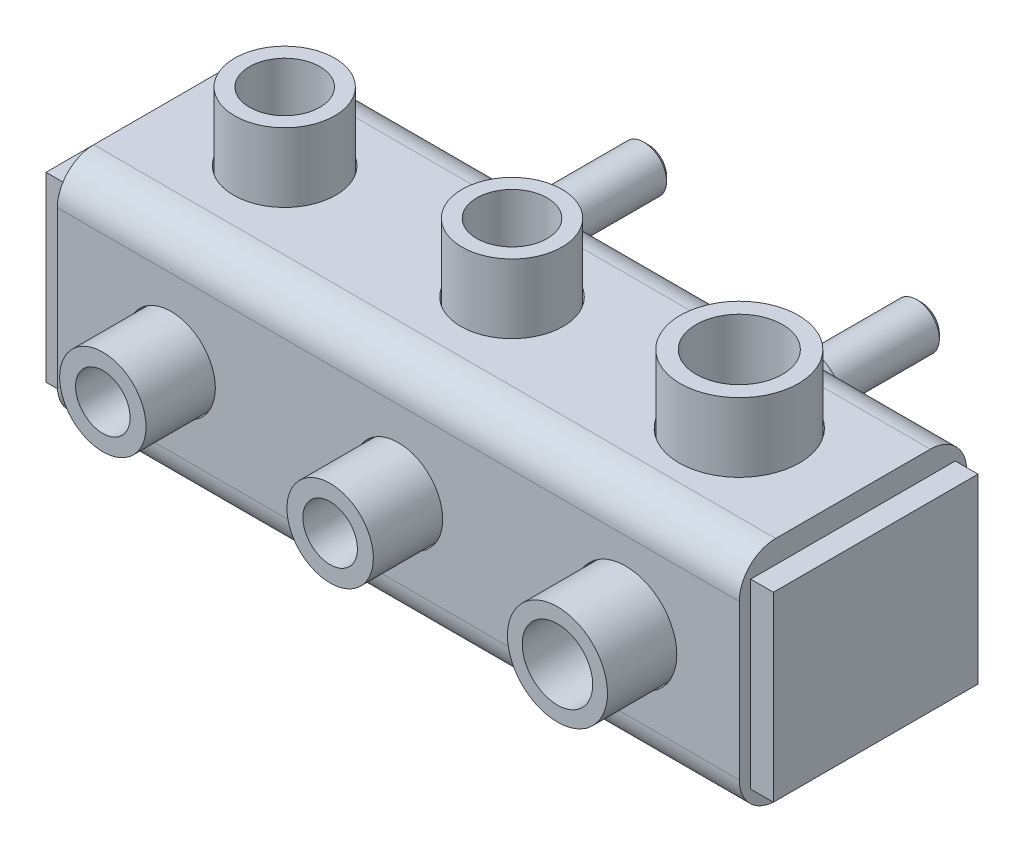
ISO-10303-21;
HEADER;
FILE_DESCRIPTION(('STEP AP214'),'2;1');
FILE_NAME('part.step','',(''),(''),'','','');
FILE_SCHEMA(('AUTOMOTIVE_DESIGN { 1 0 10303 214 1 1 1 1 }'));
ENDSEC;
DATA;
#1=APPLICATION_CONTEXT('core data for automotive mechanical design processes');
#2=APPLICATION_PROTOCOL_DEFINITION('international standard','automotive_design',2000,#1);
#3=PRODUCT_CONTEXT('',#1,'mechanical');
#4=PRODUCT('Part','Part','',(#3));
#5=PRODUCT_RELATED_PRODUCT_CATEGORY('part','',(#4));
#6=PRODUCT_DEFINITION_FORMATION('','',#4);
#7=PRODUCT_DEFINITION_CONTEXT('part definition',#1,'design');
#8=PRODUCT_DEFINITION('design','',#6,#7);
#9=PRODUCT_DEFINITION_SHAPE('','',#8);
#10=(LENGTH_UNIT() NAMED_UNIT(*) SI_UNIT(.MILLI.,.METRE.));
#11=(NAMED_UNIT(*) PLANE_ANGLE_UNIT() SI_UNIT($,.RADIAN.));
#12=(NAMED_UNIT(*) SI_UNIT($,.STERADIAN.) SOLID_ANGLE_UNIT());
#13=UNCERTAINTY_MEASURE_WITH_UNIT(LENGTH_MEASURE(1.E-05),#10,'distance_accuracy_value','');
#14=(GEOMETRIC_REPRESENTATION_CONTEXT(3) GLOBAL_UNCERTAINTY_ASSIGNED_CONTEXT((#13)) GLOBAL_UNIT_ASSIGNED_CONTEXT((#10,
#11,#12)) REPRESENTATION_CONTEXT('',''));
#15=CARTESIAN_POINT('',(0.,0.,0.));
#16=DIRECTION('',(0.,0.,1.));
#17=DIRECTION('',(1.,0.,0.));
#18=AXIS2_PLACEMENT_3D('',#15,#16,#17);
#19=CARTESIAN_POINT('',(-30.,5.,-60.));
#20=DIRECTION('',(0.,0.,1.));
#21=DIRECTION('',(0.,-1.,0.));
#22=AXIS2_PLACEMENT_3D('',#19,#20,#21);
#23=CYLINDRICAL_SURFACE('',#22,5.);
#24=CARTESIAN_POINT('',(-30.,5.,-59.));
#25=DIRECTION('',(0.,0.,-1.));
#26=DIRECTION('',(0.,1.,0.));
#27=AXIS2_PLACEMENT_3D('',#24,#25,#26);
#28=CIRCLE('',#27,5.);
#29=CARTESIAN_POINT('',(-30.,10.,-59.));
#30=VERTEX_POINT('',#29);
#31=EDGE_CURVE('E166',#30,#30,#28,.F.);
#32=ORIENTED_EDGE('',*,*,#31,.T.);
#33=EDGE_LOOP('',(#32));
#34=FACE_BOUND('',#33,.T.);
#35=CARTESIAN_POINT('',(-30.,5.,-35.));
#36=DIRECTION('',(0.,0.,1.));
#37=DIRECTION('',(0.,-1.,0.));
#38=AXIS2_PLACEMENT_3D('',#35,#36,#37);
#39=CIRCLE('',#38,5.);
#40=CARTESIAN_POINT('',(-30.,0.,-35.));
#41=VERTEX_POINT('',#40);
#42=EDGE_CURVE('E160',#41,#41,#39,.T.);
#43=ORIENTED_EDGE('',*,*,#42,.F.);
#44=EDGE_LOOP('',(#43));
#45=FACE_BOUND('',#44,.T.);
#46=ADVANCED_FACE('F49',(#34,#45),#23,.T.);
#47=CARTESIAN_POINT('',(-30.,5.,-60.));
#48=DIRECTION('',(0.,0.,-1.));
#49=DIRECTION('',(0.,1.,0.));
#50=AXIS2_PLACEMENT_3D('',#47,#48,#49);
#51=PLANE('',#50);
#52=CARTESIAN_POINT('',(-30.,5.,-60.));
#53=DIRECTION('',(0.,0.,-1.));
#54=DIRECTION('',(0.,1.,0.));
#55=AXIS2_PLACEMENT_3D('',#52,#53,#54);
#56=CIRCLE('',#55,4.);
#57=CARTESIAN_POINT('',(-30.,9.,-60.));
#58=VERTEX_POINT('',#57);
#59=EDGE_CURVE('E163',#58,#58,#56,.T.);
#60=ORIENTED_EDGE('',*,*,#59,.T.);
#61=EDGE_LOOP('',(#60));
#62=FACE_BOUND('',#61,.T.);
#63=ADVANCED_FACE('F187',(#62),#51,.T.);
#64=CARTESIAN_POINT('',(-30.,5.,-60.));
#65=DIRECTION('',(0.,0.,1.));
#66=DIRECTION('',(0.,-1.,0.));
#67=AXIS2_PLACEMENT_3D('',#64,#65,#66);
#68=CONICAL_SURFACE('',#67,4.,0.785398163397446);
#69=ORIENTED_EDGE('',*,*,#31,.F.);
#70=EDGE_LOOP('',(#69));
#71=FACE_BOUND('',#70,.T.);
#72=ORIENTED_EDGE('',*,*,#59,.F.);
#73=EDGE_LOOP('',(#72));
#74=FACE_BOUND('',#73,.T.);
#75=ADVANCED_FACE('F192',(#71,#74),#68,.T.);
#76=CARTESIAN_POINT('',(-30.,5.,-35.));
#77=DIRECTION('',(0.,0.,1.));
#78=DIRECTION('',(0.,-1.,0.));
#79=AXIS2_PLACEMENT_3D('',#76,#77,#78);
#80=PLANE('',#79);
#81=CARTESIAN_POINT('',(-30.,5.,-35.));
#82=DIRECTION('',(0.,0.,1.));
#83=DIRECTION('',(0.,-1.,0.));
#84=AXIS2_PLACEMENT_3D('',#81,#82,#83);
#85=CIRCLE('',#84,8.);
#86=CARTESIAN_POINT('',(-30.,-3.,-35.));
#87=VERTEX_POINT('',#86);
#88=EDGE_CURVE('E151',#87,#87,#85,.T.);
#89=ORIENTED_EDGE('',*,*,#88,.F.);
#90=EDGE_LOOP('',(#89));
#91=FACE_BOUND('',#90,.T.);
#92=ORIENTED_EDGE('',*,*,#42,.T.);
#93=EDGE_LOOP('',(#92));
#94=FACE_BOUND('',#93,.T.);
#95=ADVANCED_FACE('F198',(#91,#94),#80,.F.);
#96=CARTESIAN_POINT('',(-30.,5.,-25.));
#97=DIRECTION('',(0.,0.,-1.));
#98=DIRECTION('',(0.,1.,0.));
#99=AXIS2_PLACEMENT_3D('',#96,#97,#98);
#100=CYLINDRICAL_SURFACE('',#99,8.);
#101=CARTESIAN_POINT('',(-30.,5.,-26.));
#102=DIRECTION('',(0.,0.,1.));
#103=DIRECTION('',(0.,-1.,0.));
#104=AXIS2_PLACEMENT_3D('',#101,#102,#103);
#105=CIRCLE('',#104,8.);
#106=CARTESIAN_POINT('',(-30.,-3.,-26.));
#107=VERTEX_POINT('',#106);
#108=EDGE_CURVE('E12',#107,#107,#105,.F.);
#109=ORIENTED_EDGE('',*,*,#108,.T.);
#110=EDGE_LOOP('',(#109));
#111=FACE_BOUND('',#110,.T.);
#112=ORIENTED_EDGE('',*,*,#88,.T.);
#113=EDGE_LOOP('',(#112));
#114=FACE_BOUND('',#113,.T.);
#115=ADVANCED_FACE('F182',(#111,#114),#100,.T.);
#116=CARTESIAN_POINT('',(-30.,5.,-25.));
#117=DIRECTION('',(0.,0.,1.));
#118=DIRECTION('',(0.,-1.,0.));
#119=AXIS2_PLACEMENT_3D('',#116,#117,#118);
#120=PLANE('',#119);
#121=DIRECTION('',(-0.867435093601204,0.497550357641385,0.));
#122=VECTOR('',#121,1.);
#123=CARTESIAN_POINT('',(-30.,9.6,-25.));
#124=LINE('',#123,#122);
#125=CARTESIAN_POINT('',(-26.,7.30564801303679,-25.));
#126=VERTEX_POINT('',#125);
#127=CARTESIAN_POINT('',(-30.,9.6,-25.));
#128=VERTEX_POINT('',#127);
#129=EDGE_CURVE('E63',#126,#128,#124,.T.);
#130=ORIENTED_EDGE('',*,*,#129,.F.);
#131=DIRECTION('',(0.,1.,0.));
#132=VECTOR('',#131,1.);
#133=CARTESIAN_POINT('',(-26.,7.30564801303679,-25.));
#134=LINE('',#133,#132);
#135=CARTESIAN_POINT('',(-26.,2.69435198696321,-25.));
#136=VERTEX_POINT('',#135);
#137=EDGE_CURVE('E133',#136,#126,#134,.T.);
#138=ORIENTED_EDGE('',*,*,#137,.F.);
#139=DIRECTION('',(0.867435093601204,0.497550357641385,0.));
#140=VECTOR('',#139,1.);
#141=CARTESIAN_POINT('',(-26.,2.69435198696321,-25.));
#142=LINE('',#141,#140);
#143=CARTESIAN_POINT('',(-30.,0.399999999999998,-25.));
#144=VERTEX_POINT('',#143);
#145=EDGE_CURVE('E127',#144,#136,#142,.T.);
#146=ORIENTED_EDGE('',*,*,#145,.F.);
#147=DIRECTION('',(0.867435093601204,-0.497550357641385,0.));
#148=VECTOR('',#147,1.);
#149=CARTESIAN_POINT('',(-30.,0.399999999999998,-25.));
#150=LINE('',#149,#148);
#151=CARTESIAN_POINT('',(-34.,2.69435198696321,-25.));
#152=VERTEX_POINT('',#151);
#153=EDGE_CURVE('E125',#152,#144,#150,.T.);
#154=ORIENTED_EDGE('',*,*,#153,.F.);
#155=DIRECTION('',(0.,-1.,0.));
#156=VECTOR('',#155,1.);
#157=CARTESIAN_POINT('',(-34.,2.69435198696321,-25.));
#158=LINE('',#157,#156);
#159=CARTESIAN_POINT('',(-34.,7.30564801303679,-25.));
#160=VERTEX_POINT('',#159);
#161=EDGE_CURVE('E106',#160,#152,#158,.T.);
#162=ORIENTED_EDGE('',*,*,#161,.F.);
#163=DIRECTION('',(-0.867435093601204,-0.497550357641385,0.));
#164=VECTOR('',#163,1.);
#165=CARTESIAN_POINT('',(-34.,7.30564801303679,-25.));
#166=LINE('',#165,#164);
#167=EDGE_CURVE('E117',#128,#160,#166,.T.);
#168=ORIENTED_EDGE('',*,*,#167,.F.);
#169=EDGE_LOOP('',(#130,#138,#146,#154,#162,#168));
#170=FACE_BOUND('',#169,.T.);
#171=CARTESIAN_POINT('',(-30.,5.,-25.));
#172=DIRECTION('',(0.,0.,1.));
#173=DIRECTION('',(0.,-1.,0.));
#174=AXIS2_PLACEMENT_3D('',#171,#172,#173);
#175=CIRCLE('',#174,7.);
#176=CARTESIAN_POINT('',(-30.,-2.,-25.));
#177=VERTEX_POINT('',#176);
#178=EDGE_CURVE('E56',#177,#177,#175,.T.);
#179=ORIENTED_EDGE('',*,*,#178,.T.);
#180=EDGE_LOOP('',(#179));
#181=FACE_BOUND('',#180,.T.);
#182=ADVANCED_FACE('F121',(#170,#181),#120,.T.);
#183=CARTESIAN_POINT('',(-30.,5.,-26.));
#184=DIRECTION('',(0.,0.,1.));
#185=DIRECTION('',(0.,-1.,0.));
#186=AXIS2_PLACEMENT_3D('',#183,#184,#185);
#187=TOROIDAL_SURFACE('',#186,7.,1.);
#188=ORIENTED_EDGE('',*,*,#108,.F.);
#189=EDGE_LOOP('',(#188));
#190=FACE_BOUND('',#189,.T.);
#191=ORIENTED_EDGE('',*,*,#178,.F.);
#192=EDGE_LOOP('',(#191));
#193=FACE_BOUND('',#192,.T.);
#194=ADVANCED_FACE('F171',(#190,#193),#187,.T.);
#195=CARTESIAN_POINT('',(-30.,9.6,-31.));
#196=DIRECTION('',(0.497550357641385,0.867435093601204,0.));
#197=DIRECTION('',(0.867435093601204,-0.497550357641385,0.));
#198=AXIS2_PLACEMENT_3D('',#195,#196,#197);
#199=PLANE('',#198);
#200=ORIENTED_EDGE('',*,*,#129,.T.);
#201=DIRECTION('',(0.,0.,1.));
#202=VECTOR('',#201,1.);
#203=CARTESIAN_POINT('',(-30.,9.6,-31.));
#204=LINE('',#203,#202);
#205=CARTESIAN_POINT('',(-30.,9.6,-31.));
#206=VERTEX_POINT('',#205);
#207=EDGE_CURVE('E114',#206,#128,#204,.T.);
#208=ORIENTED_EDGE('',*,*,#207,.F.);
#209=DIRECTION('',(-0.867435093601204,0.497550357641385,0.));
#210=VECTOR('',#209,1.);
#211=CARTESIAN_POINT('',(-30.,9.6,-31.));
#212=LINE('',#211,#210);
#213=CARTESIAN_POINT('',(-26.,7.30564801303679,-31.));
#214=VERTEX_POINT('',#213);
#215=EDGE_CURVE('E135',#214,#206,#212,.T.);
#216=ORIENTED_EDGE('',*,*,#215,.F.);
#217=DIRECTION('',(0.,0.,1.));
#218=VECTOR('',#217,1.);
#219=CARTESIAN_POINT('',(-26.,7.30564801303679,-31.));
#220=LINE('',#219,#218);
#221=EDGE_CURVE('E70',#214,#126,#220,.T.);
#222=ORIENTED_EDGE('',*,*,#221,.T.);
#223=EDGE_LOOP('',(#200,#208,#216,#222));
#224=FACE_BOUND('',#223,.T.);
#225=ADVANCED_FACE('F173',(#224),#199,.F.);
#226=CARTESIAN_POINT('',(-26.,7.30564801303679,-31.));
#227=DIRECTION('',(1.,0.,0.));
#228=DIRECTION('',(0.,-1.,0.));
#229=AXIS2_PLACEMENT_3D('',#226,#227,#228);
#230=PLANE('',#229);
#231=ORIENTED_EDGE('',*,*,#137,.T.);
#232=ORIENTED_EDGE('',*,*,#221,.F.);
#233=DIRECTION('',(0.,1.,0.));
#234=VECTOR('',#233,1.);
#235=CARTESIAN_POINT('',(-26.,7.30564801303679,-31.));
#236=LINE('',#235,#234);
#237=CARTESIAN_POINT('',(-26.,2.69435198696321,-31.));
#238=VERTEX_POINT('',#237);
#239=EDGE_CURVE('E147',#238,#214,#236,.T.);
#240=ORIENTED_EDGE('',*,*,#239,.F.);
#241=DIRECTION('',(0.,0.,1.));
#242=VECTOR('',#241,1.);
#243=CARTESIAN_POINT('',(-26.,2.69435198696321,-31.));
#244=LINE('',#243,#242);
#245=EDGE_CURVE('E152',#238,#136,#244,.T.);
#246=ORIENTED_EDGE('',*,*,#245,.T.);
#247=EDGE_LOOP('',(#231,#232,#240,#246));
#248=FACE_BOUND('',#247,.T.);
#249=ADVANCED_FACE('F180',(#248),#230,.F.);
#250=CARTESIAN_POINT('',(-26.,2.69435198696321,-31.));
#251=DIRECTION('',(0.497550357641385,-0.867435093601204,0.));
#252=DIRECTION('',(-0.867435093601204,-0.497550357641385,0.));
#253=AXIS2_PLACEMENT_3D('',#250,#251,#252);
#254=PLANE('',#253);
#255=ORIENTED_EDGE('',*,*,#145,.T.);
#256=ORIENTED_EDGE('',*,*,#245,.F.);
#257=DIRECTION('',(0.867435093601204,0.497550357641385,0.));
#258=VECTOR('',#257,1.);
#259=CARTESIAN_POINT('',(-26.,2.69435198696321,-31.));
#260=LINE('',#259,#258);
#261=CARTESIAN_POINT('',(-30.,0.399999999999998,-31.));
#262=VERTEX_POINT('',#261);
#263=EDGE_CURVE('E144',#262,#238,#260,.T.);
#264=ORIENTED_EDGE('',*,*,#263,.F.);
#265=DIRECTION('',(0.,0.,1.));
#266=VECTOR('',#265,1.);
#267=CARTESIAN_POINT('',(-30.,0.399999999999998,-31.));
#268=LINE('',#267,#266);
#269=EDGE_CURVE('E154',#262,#144,#268,.T.);
#270=ORIENTED_EDGE('',*,*,#269,.T.);
#271=EDGE_LOOP('',(#255,#256,#264,#270));
#272=FACE_BOUND('',#271,.T.);
#273=ADVANCED_FACE('F258',(#272),#254,.F.);
#274=CARTESIAN_POINT('',(-30.,0.399999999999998,-31.));
#275=DIRECTION('',(-0.497550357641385,-0.867435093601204,0.));
#276=DIRECTION('',(-0.867435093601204,0.497550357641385,0.));
#277=AXIS2_PLACEMENT_3D('',#274,#275,#276);
#278=PLANE('',#277);
#279=ORIENTED_EDGE('',*,*,#153,.T.);
#280=ORIENTED_EDGE('',*,*,#269,.F.);
#281=DIRECTION('',(0.867435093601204,-0.497550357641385,0.));
#282=VECTOR('',#281,1.);
#283=CARTESIAN_POINT('',(-30.,0.399999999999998,-31.));
#284=LINE('',#283,#282);
#285=CARTESIAN_POINT('',(-34.,2.69435198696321,-31.));
#286=VERTEX_POINT('',#285);
#287=EDGE_CURVE('E141',#286,#262,#284,.T.);
#288=ORIENTED_EDGE('',*,*,#287,.F.);
#289=DIRECTION('',(0.,0.,1.));
#290=VECTOR('',#289,1.);
#291=CARTESIAN_POINT('',(-34.,2.69435198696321,-31.));
#292=LINE('',#291,#290);
#293=EDGE_CURVE('E113',#286,#152,#292,.T.);
#294=ORIENTED_EDGE('',*,*,#293,.T.);
#295=EDGE_LOOP('',(#279,#280,#288,#294));
#296=FACE_BOUND('',#295,.T.);
#297=ADVANCED_FACE('F266',(#296),#278,.F.);
#298=CARTESIAN_POINT('',(-34.,2.69435198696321,-31.));
#299=DIRECTION('',(-1.,0.,0.));
#300=DIRECTION('',(0.,1.,0.));
#301=AXIS2_PLACEMENT_3D('',#298,#299,#300);
#302=PLANE('',#301);
#303=ORIENTED_EDGE('',*,*,#161,.T.);
#304=ORIENTED_EDGE('',*,*,#293,.F.);
#305=DIRECTION('',(0.,-1.,0.));
#306=VECTOR('',#305,1.);
#307=CARTESIAN_POINT('',(-34.,2.69435198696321,-31.));
#308=LINE('',#307,#306);
#309=CARTESIAN_POINT('',(-34.,7.30564801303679,-31.));
#310=VERTEX_POINT('',#309);
#311=EDGE_CURVE('E109',#310,#286,#308,.T.);
#312=ORIENTED_EDGE('',*,*,#311,.F.);
#313=DIRECTION('',(0.,0.,1.));
#314=VECTOR('',#313,1.);
#315=CARTESIAN_POINT('',(-34.,7.30564801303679,-31.));
#316=LINE('',#315,#314);
#317=EDGE_CURVE('E102',#310,#160,#316,.T.);
#318=ORIENTED_EDGE('',*,*,#317,.T.);
#319=EDGE_LOOP('',(#303,#304,#312,#318));
#320=FACE_BOUND('',#319,.T.);
#321=ADVANCED_FACE('F104',(#320),#302,.F.);
#322=CARTESIAN_POINT('',(-34.,7.30564801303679,-31.));
#323=DIRECTION('',(-0.497550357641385,0.867435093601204,0.));
#324=DIRECTION('',(0.867435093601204,0.497550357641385,0.));
#325=AXIS2_PLACEMENT_3D('',#322,#323,#324);
#326=PLANE('',#325);
#327=ORIENTED_EDGE('',*,*,#167,.T.);
#328=ORIENTED_EDGE('',*,*,#317,.F.);
#329=DIRECTION('',(-0.867435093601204,-0.497550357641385,0.));
#330=VECTOR('',#329,1.);
#331=CARTESIAN_POINT('',(-34.,7.30564801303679,-31.));
#332=LINE('',#331,#330);
#333=EDGE_CURVE('E138',#206,#310,#332,.T.);
#334=ORIENTED_EDGE('',*,*,#333,.F.);
#335=ORIENTED_EDGE('',*,*,#207,.T.);
#336=EDGE_LOOP('',(#327,#328,#334,#335));
#337=FACE_BOUND('',#336,.T.);
#338=ADVANCED_FACE('F118',(#337),#326,.F.);
#339=CARTESIAN_POINT('',(-26.,7.30564801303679,-31.));
#340=DIRECTION('',(0.,0.,-1.));
#341=DIRECTION('',(0.,1.,0.));
#342=AXIS2_PLACEMENT_3D('',#339,#340,#341);
#343=PLANE('',#342);
#344=ORIENTED_EDGE('',*,*,#215,.T.);
#345=ORIENTED_EDGE('',*,*,#333,.T.);
#346=ORIENTED_EDGE('',*,*,#311,.T.);
#347=ORIENTED_EDGE('',*,*,#287,.T.);
#348=ORIENTED_EDGE('',*,*,#263,.T.);
#349=ORIENTED_EDGE('',*,*,#239,.T.);
#350=EDGE_LOOP('',(#344,#345,#346,#347,#348,#349));
#351=FACE_BOUND('',#350,.T.);
#352=ADVANCED_FACE('F290',(#351),#343,.F.);
#353=CLOSED_SHELL('',(#46,#63,#75,#95,#115,#182,#194,#225,#249,#273,#297,#321,#338,#352));
#354=MANIFOLD_SOLID_BREP('B2',#353);
#355=CARTESIAN_POINT('',(30.,5.,-60.));
#356=DIRECTION('',(0.,0.,1.));
#357=DIRECTION('',(0.,-1.,0.));
#358=AXIS2_PLACEMENT_3D('',#355,#356,#357);
#359=CYLINDRICAL_SURFACE('',#358,5.);
#360=CARTESIAN_POINT('',(30.,5.,-59.));
#361=DIRECTION('',(0.,0.,-1.));
#362=DIRECTION('',(0.,1.,0.));
#363=AXIS2_PLACEMENT_3D('',#360,#361,#362);
#364=CIRCLE('',#363,5.);
#365=CARTESIAN_POINT('',(30.,10.,-59.));
#366=VERTEX_POINT('',#365);
#367=EDGE_CURVE('E441',#366,#366,#364,.F.);
#368=ORIENTED_EDGE('',*,*,#367,.T.);
#369=EDGE_LOOP('',(#368));
#370=FACE_BOUND('',#369,.T.);
#371=CARTESIAN_POINT('',(30.,5.,-35.));
#372=DIRECTION('',(0.,0.,1.));
#373=DIRECTION('',(0.,-1.,0.));
#374=AXIS2_PLACEMENT_3D('',#371,#372,#373);
#375=CIRCLE('',#374,5.);
#376=CARTESIAN_POINT('',(30.,0.,-35.));
#377=VERTEX_POINT('',#376);
#378=EDGE_CURVE('E435',#377,#377,#375,.T.);
#379=ORIENTED_EDGE('',*,*,#378,.F.);
#380=EDGE_LOOP('',(#379));
#381=FACE_BOUND('',#380,.T.);
#382=ADVANCED_FACE('F324',(#370,#381),#359,.T.);
#383=CARTESIAN_POINT('',(30.,5.,-60.));
#384=DIRECTION('',(0.,0.,-1.));
#385=DIRECTION('',(0.,1.,0.));
#386=AXIS2_PLACEMENT_3D('',#383,#384,#385);
#387=PLANE('',#386);
#388=CARTESIAN_POINT('',(30.,5.,-60.));
#389=DIRECTION('',(0.,0.,-1.));
#390=DIRECTION('',(0.,1.,0.));
#391=AXIS2_PLACEMENT_3D('',#388,#389,#390);
#392=CIRCLE('',#391,4.);
#393=CARTESIAN_POINT('',(30.,9.00000000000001,-60.));
#394=VERTEX_POINT('',#393);
#395=EDGE_CURVE('E438',#394,#394,#392,.T.);
#396=ORIENTED_EDGE('',*,*,#395,.T.);
#397=EDGE_LOOP('',(#396));
#398=FACE_BOUND('',#397,.T.);
#399=ADVANCED_FACE('F462',(#398),#387,.T.);
#400=CARTESIAN_POINT('',(30.,5.,-60.));
#401=DIRECTION('',(0.,0.,1.));
#402=DIRECTION('',(0.,-1.,0.));
#403=AXIS2_PLACEMENT_3D('',#400,#401,#402);
#404=CONICAL_SURFACE('',#403,4.,0.785398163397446);
#405=ORIENTED_EDGE('',*,*,#367,.F.);
#406=EDGE_LOOP('',(#405));
#407=FACE_BOUND('',#406,.T.);
#408=ORIENTED_EDGE('',*,*,#395,.F.);
#409=EDGE_LOOP('',(#408));
#410=FACE_BOUND('',#409,.T.);
#411=ADVANCED_FACE('F467',(#407,#410),#404,.T.);
#412=CARTESIAN_POINT('',(30.,5.,-35.));
#413=DIRECTION('',(0.,0.,1.));
#414=DIRECTION('',(0.,-1.,0.));
#415=AXIS2_PLACEMENT_3D('',#412,#413,#414);
#416=PLANE('',#415);
#417=CARTESIAN_POINT('',(30.,5.,-35.));
#418=DIRECTION('',(0.,0.,1.));
#419=DIRECTION('',(0.,-1.,0.));
#420=AXIS2_PLACEMENT_3D('',#417,#418,#419);
#421=CIRCLE('',#420,8.);
#422=CARTESIAN_POINT('',(30.,-3.,-35.));
#423=VERTEX_POINT('',#422);
#424=EDGE_CURVE('E426',#423,#423,#421,.T.);
#425=ORIENTED_EDGE('',*,*,#424,.F.);
#426=EDGE_LOOP('',(#425));
#427=FACE_BOUND('',#426,.T.);
#428=ORIENTED_EDGE('',*,*,#378,.T.);
#429=EDGE_LOOP('',(#428));
#430=FACE_BOUND('',#429,.T.);
#431=ADVANCED_FACE('F473',(#427,#430),#416,.F.);
#432=CARTESIAN_POINT('',(30.,5.,-25.));
#433=DIRECTION('',(0.,0.,-1.));
#434=DIRECTION('',(0.,1.,0.));
#435=AXIS2_PLACEMENT_3D('',#432,#433,#434);
#436=CYLINDRICAL_SURFACE('',#435,8.);
#437=CARTESIAN_POINT('',(30.,5.,-26.));
#438=DIRECTION('',(0.,0.,1.));
#439=DIRECTION('',(0.,-1.,0.));
#440=AXIS2_PLACEMENT_3D('',#437,#438,#439);
#441=CIRCLE('',#440,8.);
#442=CARTESIAN_POINT('',(30.,-3.,-26.));
#443=VERTEX_POINT('',#442);
#444=EDGE_CURVE('E47',#443,#443,#441,.F.);
#445=ORIENTED_EDGE('',*,*,#444,.T.);
#446=EDGE_LOOP('',(#445));
#447=FACE_BOUND('',#446,.T.);
#448=ORIENTED_EDGE('',*,*,#424,.T.);
#449=EDGE_LOOP('',(#448));
#450=FACE_BOUND('',#449,.T.);
#451=ADVANCED_FACE('F457',(#447,#450),#436,.T.);
#452=CARTESIAN_POINT('',(30.,5.,-25.));
#453=DIRECTION('',(0.,0.,1.));
#454=DIRECTION('',(0.,-1.,0.));
#455=AXIS2_PLACEMENT_3D('',#452,#453,#454);
#456=PLANE('',#455);
#457=DIRECTION('',(-0.867435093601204,0.497550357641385,0.));
#458=VECTOR('',#457,1.);
#459=CARTESIAN_POINT('',(30.,9.6,-25.));
#460=LINE('',#459,#458);
#461=CARTESIAN_POINT('',(34.,7.3056480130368,-25.));
#462=VERTEX_POINT('',#461);
#463=CARTESIAN_POINT('',(30.,9.6,-25.));
#464=VERTEX_POINT('',#463);
#465=EDGE_CURVE('E338',#462,#464,#460,.T.);
#466=ORIENTED_EDGE('',*,*,#465,.F.);
#467=DIRECTION('',(0.,1.,0.));
#468=VECTOR('',#467,1.);
#469=CARTESIAN_POINT('',(34.,7.3056480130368,-25.));
#470=LINE('',#469,#468);
#471=CARTESIAN_POINT('',(34.,2.69435198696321,-25.));
#472=VERTEX_POINT('',#471);
#473=EDGE_CURVE('E408',#472,#462,#470,.T.);
#474=ORIENTED_EDGE('',*,*,#473,.F.);
#475=DIRECTION('',(0.867435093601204,0.497550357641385,0.));
#476=VECTOR('',#475,1.);
#477=CARTESIAN_POINT('',(34.,2.69435198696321,-25.));
#478=LINE('',#477,#476);
#479=CARTESIAN_POINT('',(30.,0.400000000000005,-25.));
#480=VERTEX_POINT('',#479);
#481=EDGE_CURVE('E402',#480,#472,#478,.T.);
#482=ORIENTED_EDGE('',*,*,#481,.F.);
#483=DIRECTION('',(0.867435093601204,-0.497550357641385,0.));
#484=VECTOR('',#483,1.);
#485=CARTESIAN_POINT('',(30.,0.400000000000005,-25.));
#486=LINE('',#485,#484);
#487=CARTESIAN_POINT('',(26.,2.69435198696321,-25.));
#488=VERTEX_POINT('',#487);
#489=EDGE_CURVE('E400',#488,#480,#486,.T.);
#490=ORIENTED_EDGE('',*,*,#489,.F.);
#491=DIRECTION('',(0.,-1.,0.));
#492=VECTOR('',#491,1.);
#493=CARTESIAN_POINT('',(26.,2.69435198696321,-25.));
#494=LINE('',#493,#492);
#495=CARTESIAN_POINT('',(26.,7.3056480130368,-25.));
#496=VERTEX_POINT('',#495);
#497=EDGE_CURVE('E381',#496,#488,#494,.T.);
#498=ORIENTED_EDGE('',*,*,#497,.F.);
#499=DIRECTION('',(-0.867435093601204,-0.497550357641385,0.));
#500=VECTOR('',#499,1.);
#501=CARTESIAN_POINT('',(26.,7.3056480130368,-25.));
#502=LINE('',#501,#500);
#503=EDGE_CURVE('E392',#464,#496,#502,.T.);
#504=ORIENTED_EDGE('',*,*,#503,.F.);
#505=EDGE_LOOP('',(#466,#474,#482,#490,#498,#504));
#506=FACE_BOUND('',#505,.T.);
#507=CARTESIAN_POINT('',(30.,5.,-25.));
#508=DIRECTION('',(0.,0.,1.));
#509=DIRECTION('',(0.,-1.,0.));
#510=AXIS2_PLACEMENT_3D('',#507,#508,#509);
#511=CIRCLE('',#510,7.);
#512=CARTESIAN_POINT('',(30.,-2.,-25.));
#513=VERTEX_POINT('',#512);
#514=EDGE_CURVE('E331',#513,#513,#511,.T.);
#515=ORIENTED_EDGE('',*,*,#514,.T.);
#516=EDGE_LOOP('',(#515));
#517=FACE_BOUND('',#516,.T.);
#518=ADVANCED_FACE('F396',(#506,#517),#456,.T.);
#519=CARTESIAN_POINT('',(30.,5.,-26.));
#520=DIRECTION('',(0.,0.,1.));
#521=DIRECTION('',(0.,-1.,0.));
#522=AXIS2_PLACEMENT_3D('',#519,#520,#521);
#523=TOROIDAL_SURFACE('',#522,7.,1.);
#524=ORIENTED_EDGE('',*,*,#444,.F.);
#525=EDGE_LOOP('',(#524));
#526=FACE_BOUND('',#525,.T.);
#527=ORIENTED_EDGE('',*,*,#514,.F.);
#528=EDGE_LOOP('',(#527));
#529=FACE_BOUND('',#528,.T.);
#530=ADVANCED_FACE('F446',(#526,#529),#523,.T.);
#531=CARTESIAN_POINT('',(30.,9.6,-31.));
#532=DIRECTION('',(0.497550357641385,0.867435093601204,0.));
#533=DIRECTION('',(0.867435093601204,-0.497550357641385,0.));
#534=AXIS2_PLACEMENT_3D('',#531,#532,#533);
#535=PLANE('',#534);
#536=ORIENTED_EDGE('',*,*,#465,.T.);
#537=DIRECTION('',(0.,0.,1.));
#538=VECTOR('',#537,1.);
#539=CARTESIAN_POINT('',(30.,9.6,-31.));
#540=LINE('',#539,#538);
#541=CARTESIAN_POINT('',(30.,9.6,-31.));
#542=VERTEX_POINT('',#541);
#543=EDGE_CURVE('E389',#542,#464,#540,.T.);
#544=ORIENTED_EDGE('',*,*,#543,.F.);
#545=DIRECTION('',(-0.867435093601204,0.497550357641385,0.));
#546=VECTOR('',#545,1.);
#547=CARTESIAN_POINT('',(30.,9.6,-31.));
#548=LINE('',#547,#546);
#549=CARTESIAN_POINT('',(34.,7.3056480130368,-31.));
#550=VERTEX_POINT('',#549);
#551=EDGE_CURVE('E410',#550,#542,#548,.T.);
#552=ORIENTED_EDGE('',*,*,#551,.F.);
#553=DIRECTION('',(0.,0.,1.));
#554=VECTOR('',#553,1.);
#555=CARTESIAN_POINT('',(34.,7.3056480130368,-31.));
#556=LINE('',#555,#554);
#557=EDGE_CURVE('E345',#550,#462,#556,.T.);
#558=ORIENTED_EDGE('',*,*,#557,.T.);
#559=EDGE_LOOP('',(#536,#544,#552,#558));
#560=FACE_BOUND('',#559,.T.);
#561=ADVANCED_FACE('F448',(#560),#535,.F.);
#562=CARTESIAN_POINT('',(34.,7.3056480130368,-31.));
#563=DIRECTION('',(1.,0.,0.));
#564=DIRECTION('',(0.,-1.,0.));
#565=AXIS2_PLACEMENT_3D('',#562,#563,#564);
#566=PLANE('',#565);
#567=ORIENTED_EDGE('',*,*,#473,.T.);
#568=ORIENTED_EDGE('',*,*,#557,.F.);
#569=DIRECTION('',(0.,1.,0.));
#570=VECTOR('',#569,1.);
#571=CARTESIAN_POINT('',(34.,7.3056480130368,-31.));
#572=LINE('',#571,#570);
#573=CARTESIAN_POINT('',(34.,2.69435198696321,-31.));
#574=VERTEX_POINT('',#573);
#575=EDGE_CURVE('E422',#574,#550,#572,.T.);
#576=ORIENTED_EDGE('',*,*,#575,.F.);
#577=DIRECTION('',(0.,0.,1.));
#578=VECTOR('',#577,1.);
#579=CARTESIAN_POINT('',(34.,2.69435198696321,-31.));
#580=LINE('',#579,#578);
#581=EDGE_CURVE('E427',#574,#472,#580,.T.);
#582=ORIENTED_EDGE('',*,*,#581,.T.);
#583=EDGE_LOOP('',(#567,#568,#576,#582));
#584=FACE_BOUND('',#583,.T.);
#585=ADVANCED_FACE('F455',(#584),#566,.F.);
#586=CARTESIAN_POINT('',(34.,2.69435198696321,-31.));
#587=DIRECTION('',(0.497550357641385,-0.867435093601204,0.));
#588=DIRECTION('',(-0.867435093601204,-0.497550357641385,0.));
#589=AXIS2_PLACEMENT_3D('',#586,#587,#588);
#590=PLANE('',#589);
#591=ORIENTED_EDGE('',*,*,#481,.T.);
#592=ORIENTED_EDGE('',*,*,#581,.F.);
#593=DIRECTION('',(0.867435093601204,0.497550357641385,0.));
#594=VECTOR('',#593,1.);
#595=CARTESIAN_POINT('',(34.,2.69435198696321,-31.));
#596=LINE('',#595,#594);
#597=CARTESIAN_POINT('',(30.,0.400000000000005,-31.));
#598=VERTEX_POINT('',#597);
#599=EDGE_CURVE('E419',#598,#574,#596,.T.);
#600=ORIENTED_EDGE('',*,*,#599,.F.);
#601=DIRECTION('',(0.,0.,1.));
#602=VECTOR('',#601,1.);
#603=CARTESIAN_POINT('',(30.,0.400000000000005,-31.));
#604=LINE('',#603,#602);
#605=EDGE_CURVE('E429',#598,#480,#604,.T.);
#606=ORIENTED_EDGE('',*,*,#605,.T.);
#607=EDGE_LOOP('',(#591,#592,#600,#606));
#608=FACE_BOUND('',#607,.T.);
#609=ADVANCED_FACE('F533',(#608),#590,.F.);
#610=CARTESIAN_POINT('',(30.,0.400000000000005,-31.));
#611=DIRECTION('',(-0.497550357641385,-0.867435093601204,0.));
#612=DIRECTION('',(-0.867435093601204,0.497550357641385,0.));
#613=AXIS2_PLACEMENT_3D('',#610,#611,#612);
#614=PLANE('',#613);
#615=ORIENTED_EDGE('',*,*,#489,.T.);
#616=ORIENTED_EDGE('',*,*,#605,.F.);
#617=DIRECTION('',(0.867435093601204,-0.497550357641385,0.));
#618=VECTOR('',#617,1.);
#619=CARTESIAN_POINT('',(30.,0.400000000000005,-31.));
#620=LINE('',#619,#618);
#621=CARTESIAN_POINT('',(26.,2.69435198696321,-31.));
#622=VERTEX_POINT('',#621);
#623=EDGE_CURVE('E416',#622,#598,#620,.T.);
#624=ORIENTED_EDGE('',*,*,#623,.F.);
#625=DIRECTION('',(0.,0.,1.));
#626=VECTOR('',#625,1.);
#627=CARTESIAN_POINT('',(26.,2.69435198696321,-31.));
#628=LINE('',#627,#626);
#629=EDGE_CURVE('E388',#622,#488,#628,.T.);
#630=ORIENTED_EDGE('',*,*,#629,.T.);
#631=EDGE_LOOP('',(#615,#616,#624,#630));
#632=FACE_BOUND('',#631,.T.);
#633=ADVANCED_FACE('F541',(#632),#614,.F.);
#634=CARTESIAN_POINT('',(26.,2.69435198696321,-31.));
#635=DIRECTION('',(-1.,0.,0.));
#636=DIRECTION('',(0.,1.,0.));
#637=AXIS2_PLACEMENT_3D('',#634,#635,#636);
#638=PLANE('',#637);
#639=ORIENTED_EDGE('',*,*,#497,.T.);
#640=ORIENTED_EDGE('',*,*,#629,.F.);
#641=DIRECTION('',(0.,-1.,0.));
#642=VECTOR('',#641,1.);
#643=CARTESIAN_POINT('',(26.,2.69435198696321,-31.));
#644=LINE('',#643,#642);
#645=CARTESIAN_POINT('',(26.,7.3056480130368,-31.));
#646=VERTEX_POINT('',#645);
#647=EDGE_CURVE('E384',#646,#622,#644,.T.);
#648=ORIENTED_EDGE('',*,*,#647,.F.);
#649=DIRECTION('',(0.,0.,1.));
#650=VECTOR('',#649,1.);
#651=CARTESIAN_POINT('',(26.,7.3056480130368,-31.));
#652=LINE('',#651,#650);
#653=EDGE_CURVE('E377',#646,#496,#652,.T.);
#654=ORIENTED_EDGE('',*,*,#653,.T.);
#655=EDGE_LOOP('',(#639,#640,#648,#654));
#656=FACE_BOUND('',#655,.T.);
#657=ADVANCED_FACE('F379',(#656),#638,.F.);
#658=CARTESIAN_POINT('',(26.,7.3056480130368,-31.));
#659=DIRECTION('',(-0.497550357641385,0.867435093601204,0.));
#660=DIRECTION('',(0.867435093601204,0.497550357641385,0.));
#661=AXIS2_PLACEMENT_3D('',#658,#659,#660);
#662=PLANE('',#661);
#663=ORIENTED_EDGE('',*,*,#503,.T.);
#664=ORIENTED_EDGE('',*,*,#653,.F.);
#665=DIRECTION('',(-0.867435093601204,-0.497550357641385,0.));
#666=VECTOR('',#665,1.);
#667=CARTESIAN_POINT('',(26.,7.3056480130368,-31.));
#668=LINE('',#667,#666);
#669=EDGE_CURVE('E413',#542,#646,#668,.T.);
#670=ORIENTED_EDGE('',*,*,#669,.F.);
#671=ORIENTED_EDGE('',*,*,#543,.T.);
#672=EDGE_LOOP('',(#663,#664,#670,#671));
#673=FACE_BOUND('',#672,.T.);
#674=ADVANCED_FACE('F393',(#673),#662,.F.);
#675=CARTESIAN_POINT('',(34.,7.3056480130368,-31.));
#676=DIRECTION('',(0.,0.,-1.));
#677=DIRECTION('',(0.,1.,0.));
#678=AXIS2_PLACEMENT_3D('',#675,#676,#677);
#679=PLANE('',#678);
#680=ORIENTED_EDGE('',*,*,#551,.T.);
#681=ORIENTED_EDGE('',*,*,#669,.T.);
#682=ORIENTED_EDGE('',*,*,#647,.T.);
#683=ORIENTED_EDGE('',*,*,#623,.T.);
#684=ORIENTED_EDGE('',*,*,#599,.T.);
#685=ORIENTED_EDGE('',*,*,#575,.T.);
#686=EDGE_LOOP('',(#680,#681,#682,#683,#684,#685));
#687=FACE_BOUND('',#686,.T.);
#688=ADVANCED_FACE('F565',(#687),#679,.F.);
#689=CLOSED_SHELL('',(#382,#399,#411,#431,#451,#518,#530,#561,#585,#609,#633,#657,#674,#688));
#690=MANIFOLD_SOLID_BREP('B6',#689);
#691=CARTESIAN_POINT('',(50.,40.,0.));
#692=DIRECTION('',(0.,1.,0.));
#693=DIRECTION('',(0.,0.,1.));
#694=AXIS2_PLACEMENT_3D('',#691,#692,#693);
#695=PLANE('',#694);
#696=CARTESIAN_POINT('',(50.,40.,0.));
#697=DIRECTION('',(0.,1.,0.));
#698=DIRECTION('',(0.,0.,1.));
#699=AXIS2_PLACEMENT_3D('',#696,#697,#698);
#700=CIRCLE('',#699,13.);
#701=CARTESIAN_POINT('',(50.,40.,13.));
#702=VERTEX_POINT('',#701);
#703=EDGE_CURVE('E323',#702,#702,#700,.T.);
#704=ORIENTED_EDGE('',*,*,#703,.T.);
#705=EDGE_LOOP('',(#704));
#706=FACE_BOUND('',#705,.T.);
#707=CARTESIAN_POINT('',(50.,40.,0.));
#708=DIRECTION('',(0.,1.,0.));
#709=DIRECTION('',(0.,0.,1.));
#710=AXIS2_PLACEMENT_3D('',#707,#708,#709);
#711=CIRCLE('',#710,9.5);
#712=CARTESIAN_POINT('',(50.,40.,9.5));
#713=VERTEX_POINT('',#712);
#714=EDGE_CURVE('E614',#713,#713,#711,.T.);
#715=ORIENTED_EDGE('',*,*,#714,.F.);
#716=EDGE_LOOP('',(#715));
#717=FACE_BOUND('',#716,.T.);
#718=ADVANCED_FACE('F603',(#706,#717),#695,.T.);
#719=CARTESIAN_POINT('',(50.,10.,0.));
#720=DIRECTION('',(0.,1.,0.));
#721=DIRECTION('',(0.,0.,1.));
#722=AXIS2_PLACEMENT_3D('',#719,#720,#721);
#723=PLANE('',#722);
#724=CARTESIAN_POINT('',(50.,10.,0.));
#725=DIRECTION('',(0.,1.,0.));
#726=DIRECTION('',(0.,0.,1.));
#727=AXIS2_PLACEMENT_3D('',#724,#725,#726);
#728=CIRCLE('',#727,13.);
#729=CARTESIAN_POINT('',(50.,10.,13.));
#730=VERTEX_POINT('',#729);
#731=EDGE_CURVE('E610',#730,#730,#728,.T.);
#732=ORIENTED_EDGE('',*,*,#731,.F.);
#733=EDGE_LOOP('',(#732));
#734=FACE_BOUND('',#733,.T.);
#735=CARTESIAN_POINT('',(50.,10.,0.));
#736=DIRECTION('',(0.,1.,0.));
#737=DIRECTION('',(0.,0.,1.));
#738=AXIS2_PLACEMENT_3D('',#735,#736,#737);
#739=CIRCLE('',#738,9.5);
#740=CARTESIAN_POINT('',(50.,10.,9.5));
#741=VERTEX_POINT('',#740);
#742=EDGE_CURVE('E618',#741,#741,#739,.T.);
#743=ORIENTED_EDGE('',*,*,#742,.T.);
#744=EDGE_LOOP('',(#743));
#745=FACE_BOUND('',#744,.T.);
#746=ADVANCED_FACE('F624',(#734,#745),#723,.F.);
#747=CARTESIAN_POINT('',(50.,40.,0.));
#748=DIRECTION('',(0.,-1.,0.));
#749=DIRECTION('',(0.,0.,-1.));
#750=AXIS2_PLACEMENT_3D('',#747,#748,#749);
#751=CYLINDRICAL_SURFACE('',#750,13.);
#752=ORIENTED_EDGE('',*,*,#703,.F.);
#753=EDGE_LOOP('',(#752));
#754=FACE_BOUND('',#753,.T.);
#755=ORIENTED_EDGE('',*,*,#731,.T.);
#756=EDGE_LOOP('',(#755));
#757=FACE_BOUND('',#756,.T.);
#758=ADVANCED_FACE('F605',(#754,#757),#751,.T.);
#759=CARTESIAN_POINT('',(50.,40.,0.));
#760=DIRECTION('',(0.,-1.,0.));
#761=DIRECTION('',(0.,0.,-1.));
#762=AXIS2_PLACEMENT_3D('',#759,#760,#761);
#763=CYLINDRICAL_SURFACE('',#762,9.5);
#764=ORIENTED_EDGE('',*,*,#714,.T.);
#765=EDGE_LOOP('',(#764));
#766=FACE_BOUND('',#765,.T.);
#767=ORIENTED_EDGE('',*,*,#742,.F.);
#768=EDGE_LOOP('',(#767));
#769=FACE_BOUND('',#768,.T.);
#770=ADVANCED_FACE('F626',(#766,#769),#763,.F.);
#771=CLOSED_SHELL('',(#718,#746,#758,#770));
#772=MANIFOLD_SOLID_BREP('B41',#771);
#773=CARTESIAN_POINT('',(0.,0.,40.));
#774=DIRECTION('',(0.,0.,1.));
#775=DIRECTION('',(0.,-1.,0.));
#776=AXIS2_PLACEMENT_3D('',#773,#774,#775);
#777=PLANE('',#776);
#778=CARTESIAN_POINT('',(0.,0.,40.));
#779=DIRECTION('',(0.,0.,1.));
#780=DIRECTION('',(0.,-1.,0.));
#781=AXIS2_PLACEMENT_3D('',#778,#779,#780);
#782=CIRCLE('',#781,9.5);
#783=CARTESIAN_POINT('',(0.,-9.5,40.));
#784=VERTEX_POINT('',#783);
#785=EDGE_CURVE('E602',#784,#784,#782,.T.);
#786=ORIENTED_EDGE('',*,*,#785,.T.);
#787=EDGE_LOOP('',(#786));
#788=FACE_BOUND('',#787,.T.);
#789=CARTESIAN_POINT('',(0.,0.,40.));
#790=DIRECTION('',(0.,0.,1.));
#791=DIRECTION('',(0.,-1.,0.));
#792=AXIS2_PLACEMENT_3D('',#789,#790,#791);
#793=CIRCLE('',#792,6.);
#794=CARTESIAN_POINT('',(0.,-6.,40.));
#795=VERTEX_POINT('',#794);
#796=EDGE_CURVE('E683',#795,#795,#793,.T.);
#797=ORIENTED_EDGE('',*,*,#796,.F.);
#798=EDGE_LOOP('',(#797));
#799=FACE_BOUND('',#798,.T.);
#800=ADVANCED_FACE('F672',(#788,#799),#777,.T.);
#801=CARTESIAN_POINT('',(0.,0.,9.99999999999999));
#802=DIRECTION('',(0.,0.,1.));
#803=DIRECTION('',(0.,-1.,0.));
#804=AXIS2_PLACEMENT_3D('',#801,#802,#803);
#805=PLANE('',#804);
#806=CARTESIAN_POINT('',(0.,0.,9.99999999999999));
#807=DIRECTION('',(0.,0.,1.));
#808=DIRECTION('',(0.,-1.,0.));
#809=AXIS2_PLACEMENT_3D('',#806,#807,#808);
#810=CIRCLE('',#809,9.5);
#811=CARTESIAN_POINT('',(0.,-9.5,9.99999999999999));
#812=VERTEX_POINT('',#811);
#813=EDGE_CURVE('E679',#812,#812,#810,.T.);
#814=ORIENTED_EDGE('',*,*,#813,.F.);
#815=EDGE_LOOP('',(#814));
#816=FACE_BOUND('',#815,.T.);
#817=CARTESIAN_POINT('',(0.,0.,9.99999999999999));
#818=DIRECTION('',(0.,0.,1.));
#819=DIRECTION('',(0.,-1.,0.));
#820=AXIS2_PLACEMENT_3D('',#817,#818,#819);
#821=CIRCLE('',#820,6.);
#822=CARTESIAN_POINT('',(0.,-6.,9.99999999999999));
#823=VERTEX_POINT('',#822);
#824=EDGE_CURVE('E687',#823,#823,#821,.T.);
#825=ORIENTED_EDGE('',*,*,#824,.T.);
#826=EDGE_LOOP('',(#825));
#827=FACE_BOUND('',#826,.T.);
#828=ADVANCED_FACE('F693',(#816,#827),#805,.F.);
#829=CARTESIAN_POINT('',(0.,0.,40.));
#830=DIRECTION('',(0.,0.,-1.));
#831=DIRECTION('',(0.,1.,0.));
#832=AXIS2_PLACEMENT_3D('',#829,#830,#831);
#833=CYLINDRICAL_SURFACE('',#832,9.5);
#834=ORIENTED_EDGE('',*,*,#785,.F.);
#835=EDGE_LOOP('',(#834));
#836=FACE_BOUND('',#835,.T.);
#837=ORIENTED_EDGE('',*,*,#813,.T.);
#838=EDGE_LOOP('',(#837));
#839=FACE_BOUND('',#838,.T.);
#840=ADVANCED_FACE('F674',(#836,#839),#833,.T.);
#841=CARTESIAN_POINT('',(0.,0.,40.));
#842=DIRECTION('',(0.,0.,-1.));
#843=DIRECTION('',(0.,1.,0.));
#844=AXIS2_PLACEMENT_3D('',#841,#842,#843);
#845=CYLINDRICAL_SURFACE('',#844,6.);
#846=ORIENTED_EDGE('',*,*,#796,.T.);
#847=EDGE_LOOP('',(#846));
#848=FACE_BOUND('',#847,.T.);
#849=ORIENTED_EDGE('',*,*,#824,.F.);
#850=EDGE_LOOP('',(#849));
#851=FACE_BOUND('',#850,.T.);
#852=ADVANCED_FACE('F695',(#848,#851),#845,.F.);
#853=CLOSED_SHELL('',(#800,#828,#840,#852));
#854=MANIFOLD_SOLID_BREP('B318',#853);
#855=CARTESIAN_POINT('',(-50.,0.,9.99999999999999));
#856=DIRECTION('',(0.,0.,-1.));
#857=DIRECTION('',(0.,1.,0.));
#858=AXIS2_PLACEMENT_3D('',#855,#856,#857);
#859=PLANE('',#858);
#860=CARTESIAN_POINT('',(-50.,0.,9.99999999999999));
#861=DIRECTION('',(0.,0.,-1.));
#862=DIRECTION('',(0.,1.,0.));
#863=AXIS2_PLACEMENT_3D('',#860,#861,#862);
#864=CIRCLE('',#863,9.5);
#865=CARTESIAN_POINT('',(-50.,9.5,9.99999999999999));
#866=VERTEX_POINT('',#865);
#867=EDGE_CURVE('E671',#866,#866,#864,.T.);
#868=ORIENTED_EDGE('',*,*,#867,.T.);
#869=EDGE_LOOP('',(#868));
#870=FACE_BOUND('',#869,.T.);
#871=CARTESIAN_POINT('',(-50.,0.,9.99999999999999));
#872=DIRECTION('',(0.,0.,-1.));
#873=DIRECTION('',(0.,1.,0.));
#874=AXIS2_PLACEMENT_3D('',#871,#872,#873);
#875=CIRCLE('',#874,6.);
#876=CARTESIAN_POINT('',(-50.,6.,9.99999999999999));
#877=VERTEX_POINT('',#876);
#878=EDGE_CURVE('E752',#877,#877,#875,.T.);
#879=ORIENTED_EDGE('',*,*,#878,.F.);
#880=EDGE_LOOP('',(#879));
#881=FACE_BOUND('',#880,.T.);
#882=ADVANCED_FACE('F741',(#870,#881),#859,.T.);
#883=CARTESIAN_POINT('',(-50.,0.,40.));
#884=DIRECTION('',(0.,0.,-1.));
#885=DIRECTION('',(0.,1.,0.));
#886=AXIS2_PLACEMENT_3D('',#883,#884,#885);
#887=PLANE('',#886);
#888=CARTESIAN_POINT('',(-50.,0.,40.));
#889=DIRECTION('',(0.,0.,-1.));
#890=DIRECTION('',(0.,1.,0.));
#891=AXIS2_PLACEMENT_3D('',#888,#889,#890);
#892=CIRCLE('',#891,9.5);
#893=CARTESIAN_POINT('',(-50.,9.5,40.));
#894=VERTEX_POINT('',#893);
#895=EDGE_CURVE('E748',#894,#894,#892,.T.);
#896=ORIENTED_EDGE('',*,*,#895,.F.);
#897=EDGE_LOOP('',(#896));
#898=FACE_BOUND('',#897,.T.);
#899=CARTESIAN_POINT('',(-50.,0.,40.));
#900=DIRECTION('',(0.,0.,-1.));
#901=DIRECTION('',(0.,1.,0.));
#902=AXIS2_PLACEMENT_3D('',#899,#900,#901);
#903=CIRCLE('',#902,6.);
#904=CARTESIAN_POINT('',(-50.,6.,40.));
#905=VERTEX_POINT('',#904);
#906=EDGE_CURVE('E756',#905,#905,#903,.T.);
#907=ORIENTED_EDGE('',*,*,#906,.T.);
#908=EDGE_LOOP('',(#907));
#909=FACE_BOUND('',#908,.T.);
#910=ADVANCED_FACE('F762',(#898,#909),#887,.F.);
#911=CARTESIAN_POINT('',(-50.,0.,9.99999999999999));
#912=DIRECTION('',(0.,0.,1.));
#913=DIRECTION('',(0.,-1.,0.));
#914=AXIS2_PLACEMENT_3D('',#911,#912,#913);
#915=CYLINDRICAL_SURFACE('',#914,9.5);
#916=ORIENTED_EDGE('',*,*,#867,.F.);
#917=EDGE_LOOP('',(#916));
#918=FACE_BOUND('',#917,.T.);
#919=ORIENTED_EDGE('',*,*,#895,.T.);
#920=EDGE_LOOP('',(#919));
#921=FACE_BOUND('',#920,.T.);
#922=ADVANCED_FACE('F743',(#918,#921),#915,.T.);
#923=CARTESIAN_POINT('',(-50.,0.,9.99999999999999));
#924=DIRECTION('',(0.,0.,1.));
#925=DIRECTION('',(0.,-1.,0.));
#926=AXIS2_PLACEMENT_3D('',#923,#924,#925);
#927=CYLINDRICAL_SURFACE('',#926,6.);
#928=ORIENTED_EDGE('',*,*,#878,.T.);
#929=EDGE_LOOP('',(#928));
#930=FACE_BOUND('',#929,.T.);
#931=ORIENTED_EDGE('',*,*,#906,.F.);
#932=EDGE_LOOP('',(#931));
#933=FACE_BOUND('',#932,.T.);
#934=ADVANCED_FACE('F764',(#930,#933),#927,.F.);
#935=CLOSED_SHELL('',(#882,#910,#922,#934));
#936=MANIFOLD_SOLID_BREP('B597',#935);
#937=CARTESIAN_POINT('',(50.,0.,40.));
#938=DIRECTION('',(0.,0.,1.));
#939=DIRECTION('',(0.,-1.,0.));
#940=AXIS2_PLACEMENT_3D('',#937,#938,#939);
#941=PLANE('',#940);
#942=CARTESIAN_POINT('',(50.,0.,40.));
#943=DIRECTION('',(0.,0.,1.));
#944=DIRECTION('',(0.,-1.,0.));
#945=AXIS2_PLACEMENT_3D('',#942,#943,#944);
#946=CIRCLE('',#945,11.);
#947=CARTESIAN_POINT('',(50.,-11.,40.));
#948=VERTEX_POINT('',#947);
#949=EDGE_CURVE('E740',#948,#948,#946,.T.);
#950=ORIENTED_EDGE('',*,*,#949,.T.);
#951=EDGE_LOOP('',(#950));
#952=FACE_BOUND('',#951,.T.);
#953=CARTESIAN_POINT('',(50.,0.,40.));
#954=DIRECTION('',(0.,0.,1.));
#955=DIRECTION('',(0.,-1.,0.));
#956=AXIS2_PLACEMENT_3D('',#953,#954,#955);
#957=CIRCLE('',#956,7.75);
#958=CARTESIAN_POINT('',(50.,-7.75,40.));
#959=VERTEX_POINT('',#958);
#960=EDGE_CURVE('E821',#959,#959,#957,.T.);
#961=ORIENTED_EDGE('',*,*,#960,.F.);
#962=EDGE_LOOP('',(#961));
#963=FACE_BOUND('',#962,.T.);
#964=ADVANCED_FACE('F810',(#952,#963),#941,.T.);
#965=CARTESIAN_POINT('',(50.,0.,9.99999999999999));
#966=DIRECTION('',(0.,0.,1.));
#967=DIRECTION('',(0.,-1.,0.));
#968=AXIS2_PLACEMENT_3D('',#965,#966,#967);
#969=PLANE('',#968);
#970=CARTESIAN_POINT('',(50.,0.,9.99999999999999));
#971=DIRECTION('',(0.,0.,1.));
#972=DIRECTION('',(0.,-1.,0.));
#973=AXIS2_PLACEMENT_3D('',#970,#971,#972);
#974=CIRCLE('',#973,11.);
#975=CARTESIAN_POINT('',(50.,-11.,9.99999999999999));
#976=VERTEX_POINT('',#975);
#977=EDGE_CURVE('E817',#976,#976,#974,.T.);
#978=ORIENTED_EDGE('',*,*,#977,.F.);
#979=EDGE_LOOP('',(#978));
#980=FACE_BOUND('',#979,.T.);
#981=CARTESIAN_POINT('',(50.,0.,9.99999999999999));
#982=DIRECTION('',(0.,0.,1.));
#983=DIRECTION('',(0.,-1.,0.));
#984=AXIS2_PLACEMENT_3D('',#981,#982,#983);
#985=CIRCLE('',#984,7.75);
#986=CARTESIAN_POINT('',(50.,-7.75,9.99999999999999));
#987=VERTEX_POINT('',#986);
#988=EDGE_CURVE('E825',#987,#987,#985,.T.);
#989=ORIENTED_EDGE('',*,*,#988,.T.);
#990=EDGE_LOOP('',(#989));
#991=FACE_BOUND('',#990,.T.);
#992=ADVANCED_FACE('F831',(#980,#991),#969,.F.);
#993=CARTESIAN_POINT('',(50.,0.,40.));
#994=DIRECTION('',(0.,0.,-1.));
#995=DIRECTION('',(0.,1.,0.));
#996=AXIS2_PLACEMENT_3D('',#993,#994,#995);
#997=CYLINDRICAL_SURFACE('',#996,11.);
#998=ORIENTED_EDGE('',*,*,#949,.F.);
#999=EDGE_LOOP('',(#998));
#1000=FACE_BOUND('',#999,.T.);
#1001=ORIENTED_EDGE('',*,*,#977,.T.);
#1002=EDGE_LOOP('',(#1001));
#1003=FACE_BOUND('',#1002,.T.);
#1004=ADVANCED_FACE('F812',(#1000,#1003),#997,.T.);
#1005=CARTESIAN_POINT('',(50.,0.,40.));
#1006=DIRECTION('',(0.,0.,-1.));
#1007=DIRECTION('',(0.,1.,0.));
#1008=AXIS2_PLACEMENT_3D('',#1005,#1006,#1007);
#1009=CYLINDRICAL_SURFACE('',#1008,7.75);
#1010=ORIENTED_EDGE('',*,*,#960,.T.);
#1011=EDGE_LOOP('',(#1010));
#1012=FACE_BOUND('',#1011,.T.);
#1013=ORIENTED_EDGE('',*,*,#988,.F.);
#1014=EDGE_LOOP('',(#1013));
#1015=FACE_BOUND('',#1014,.T.);
#1016=ADVANCED_FACE('F833',(#1012,#1015),#1009,.F.);
#1017=CLOSED_SHELL('',(#964,#992,#1004,#1016));
#1018=MANIFOLD_SOLID_BREP('B666',#1017);
#1019=CARTESIAN_POINT('',(-50.,40.,0.));
#1020=DIRECTION('',(0.,1.,0.));
#1021=DIRECTION('',(0.,0.,1.));
#1022=AXIS2_PLACEMENT_3D('',#1019,#1020,#1021);
#1023=PLANE('',#1022);
#1024=CARTESIAN_POINT('',(-50.,40.,0.));
#1025=DIRECTION('',(0.,1.,0.));
#1026=DIRECTION('',(0.,0.,1.));
#1027=AXIS2_PLACEMENT_3D('',#1024,#1025,#1026);
#1028=CIRCLE('',#1027,11.);
#1029=CARTESIAN_POINT('',(-50.,40.,11.));
#1030=VERTEX_POINT('',#1029);
#1031=EDGE_CURVE('E809',#1030,#1030,#1028,.T.);
#1032=ORIENTED_EDGE('',*,*,#1031,.T.);
#1033=EDGE_LOOP('',(#1032));
#1034=FACE_BOUND('',#1033,.T.);
#1035=CARTESIAN_POINT('',(-50.,40.,0.));
#1036=DIRECTION('',(0.,1.,0.));
#1037=DIRECTION('',(0.,0.,1.));
#1038=AXIS2_PLACEMENT_3D('',#1035,#1036,#1037);
#1039=CIRCLE('',#1038,7.75);
#1040=CARTESIAN_POINT('',(-50.,40.,7.75));
#1041=VERTEX_POINT('',#1040);
#1042=EDGE_CURVE('E890',#1041,#1041,#1039,.T.);
#1043=ORIENTED_EDGE('',*,*,#1042,.F.);
#1044=EDGE_LOOP('',(#1043));
#1045=FACE_BOUND('',#1044,.T.);
#1046=ADVANCED_FACE('F879',(#1034,#1045),#1023,.T.);
#1047=CARTESIAN_POINT('',(-50.,10.,0.));
#1048=DIRECTION('',(0.,1.,0.));
#1049=DIRECTION('',(0.,0.,1.));
#1050=AXIS2_PLACEMENT_3D('',#1047,#1048,#1049);
#1051=PLANE('',#1050);
#1052=CARTESIAN_POINT('',(-50.,10.,0.));
#1053=DIRECTION('',(0.,1.,0.));
#1054=DIRECTION('',(0.,0.,1.));
#1055=AXIS2_PLACEMENT_3D('',#1052,#1053,#1054);
#1056=CIRCLE('',#1055,11.);
#1057=CARTESIAN_POINT('',(-50.,10.,11.));
#1058=VERTEX_POINT('',#1057);
#1059=EDGE_CURVE('E886',#1058,#1058,#1056,.T.);
#1060=ORIENTED_EDGE('',*,*,#1059,.F.);
#1061=EDGE_LOOP('',(#1060));
#1062=FACE_BOUND('',#1061,.T.);
#1063=CARTESIAN_POINT('',(-50.,10.,0.));
#1064=DIRECTION('',(0.,1.,0.));
#1065=DIRECTION('',(0.,0.,1.));
#1066=AXIS2_PLACEMENT_3D('',#1063,#1064,#1065);
#1067=CIRCLE('',#1066,7.75);
#1068=CARTESIAN_POINT('',(-50.,10.,7.75));
#1069=VERTEX_POINT('',#1068);
#1070=EDGE_CURVE('E894',#1069,#1069,#1067,.T.);
#1071=ORIENTED_EDGE('',*,*,#1070,.T.);
#1072=EDGE_LOOP('',(#1071));
#1073=FACE_BOUND('',#1072,.T.);
#1074=ADVANCED_FACE('F900',(#1062,#1073),#1051,.F.);
#1075=CARTESIAN_POINT('',(-50.,40.,0.));
#1076=DIRECTION('',(0.,-1.,0.));
#1077=DIRECTION('',(0.,0.,-1.));
#1078=AXIS2_PLACEMENT_3D('',#1075,#1076,#1077);
#1079=CYLINDRICAL_SURFACE('',#1078,11.);
#1080=ORIENTED_EDGE('',*,*,#1031,.F.);
#1081=EDGE_LOOP('',(#1080));
#1082=FACE_BOUND('',#1081,.T.);
#1083=ORIENTED_EDGE('',*,*,#1059,.T.);
#1084=EDGE_LOOP('',(#1083));
#1085=FACE_BOUND('',#1084,.T.);
#1086=ADVANCED_FACE('F881',(#1082,#1085),#1079,.T.);
#1087=CARTESIAN_POINT('',(-50.,40.,0.));
#1088=DIRECTION('',(0.,-1.,0.));
#1089=DIRECTION('',(0.,0.,-1.));
#1090=AXIS2_PLACEMENT_3D('',#1087,#1088,#1089);
#1091=CYLINDRICAL_SURFACE('',#1090,7.75);
#1092=ORIENTED_EDGE('',*,*,#1042,.T.);
#1093=EDGE_LOOP('',(#1092));
#1094=FACE_BOUND('',#1093,.T.);
#1095=ORIENTED_EDGE('',*,*,#1070,.F.);
#1096=EDGE_LOOP('',(#1095));
#1097=FACE_BOUND('',#1096,.T.);
#1098=ADVANCED_FACE('F902',(#1094,#1097),#1091,.F.);
#1099=CLOSED_SHELL('',(#1046,#1074,#1086,#1098));
#1100=MANIFOLD_SOLID_BREP('B735',#1099);
#1101=CARTESIAN_POINT('',(0.,40.,0.));
#1102=DIRECTION('',(0.,1.,0.));
#1103=DIRECTION('',(0.,0.,1.));
#1104=AXIS2_PLACEMENT_3D('',#1101,#1102,#1103);
#1105=PLANE('',#1104);
#1106=CARTESIAN_POINT('',(0.,40.,0.));
#1107=DIRECTION('',(0.,1.,0.));
#1108=DIRECTION('',(0.,0.,1.));
#1109=AXIS2_PLACEMENT_3D('',#1106,#1107,#1108);
#1110=CIRCLE('',#1109,11.);
#1111=CARTESIAN_POINT('',(0.,40.,11.));
#1112=VERTEX_POINT('',#1111);
#1113=EDGE_CURVE('E878',#1112,#1112,#1110,.T.);
#1114=ORIENTED_EDGE('',*,*,#1113,.T.);
#1115=EDGE_LOOP('',(#1114));
#1116=FACE_BOUND('',#1115,.T.);
#1117=CARTESIAN_POINT('',(0.,40.,0.));
#1118=DIRECTION('',(0.,1.,0.));
#1119=DIRECTION('',(0.,0.,1.));
#1120=AXIS2_PLACEMENT_3D('',#1117,#1118,#1119);
#1121=CIRCLE('',#1120,7.75);
#1122=CARTESIAN_POINT('',(0.,40.,7.75));
#1123=VERTEX_POINT('',#1122);
#1124=EDGE_CURVE('E961',#1123,#1123,#1121,.T.);
#1125=ORIENTED_EDGE('',*,*,#1124,.F.);
#1126=EDGE_LOOP('',(#1125));
#1127=FACE_BOUND('',#1126,.T.);
#1128=ADVANCED_FACE('F950',(#1116,#1127),#1105,.T.);
#1129=CARTESIAN_POINT('',(0.,10.,0.));
#1130=DIRECTION('',(0.,1.,0.));
#1131=DIRECTION('',(0.,0.,1.));
#1132=AXIS2_PLACEMENT_3D('',#1129,#1130,#1131);
#1133=PLANE('',#1132);
#1134=CARTESIAN_POINT('',(0.,10.,0.));
#1135=DIRECTION('',(0.,1.,0.));
#1136=DIRECTION('',(0.,0.,1.));
#1137=AXIS2_PLACEMENT_3D('',#1134,#1135,#1136);
#1138=CIRCLE('',#1137,11.);
#1139=CARTESIAN_POINT('',(0.,10.,11.));
#1140=VERTEX_POINT('',#1139);
#1141=EDGE_CURVE('E957',#1140,#1140,#1138,.T.);
#1142=ORIENTED_EDGE('',*,*,#1141,.F.);
#1143=EDGE_LOOP('',(#1142));
#1144=FACE_BOUND('',#1143,.T.);
#1145=CARTESIAN_POINT('',(0.,10.,0.));
#1146=DIRECTION('',(0.,1.,0.));
#1147=DIRECTION('',(0.,0.,1.));
#1148=AXIS2_PLACEMENT_3D('',#1145,#1146,#1147);
#1149=CIRCLE('',#1148,7.75);
#1150=CARTESIAN_POINT('',(0.,10.,7.75));
#1151=VERTEX_POINT('',#1150);
#1152=EDGE_CURVE('E965',#1151,#1151,#1149,.T.);
#1153=ORIENTED_EDGE('',*,*,#1152,.T.);
#1154=EDGE_LOOP('',(#1153));
#1155=FACE_BOUND('',#1154,.T.);
#1156=ADVANCED_FACE('F971',(#1144,#1155),#1133,.F.);
#1157=CARTESIAN_POINT('',(0.,40.,0.));
#1158=DIRECTION('',(0.,-1.,0.));
#1159=DIRECTION('',(0.,0.,-1.));
#1160=AXIS2_PLACEMENT_3D('',#1157,#1158,#1159);
#1161=CYLINDRICAL_SURFACE('',#1160,11.);
#1162=ORIENTED_EDGE('',*,*,#1113,.F.);
#1163=EDGE_LOOP('',(#1162));
#1164=FACE_BOUND('',#1163,.T.);
#1165=ORIENTED_EDGE('',*,*,#1141,.T.);
#1166=EDGE_LOOP('',(#1165));
#1167=FACE_BOUND('',#1166,.T.);
#1168=ADVANCED_FACE('F952',(#1164,#1167),#1161,.T.);
#1169=CARTESIAN_POINT('',(0.,40.,0.));
#1170=DIRECTION('',(0.,-1.,0.));
#1171=DIRECTION('',(0.,0.,-1.));
#1172=AXIS2_PLACEMENT_3D('',#1169,#1170,#1171);
#1173=CYLINDRICAL_SURFACE('',#1172,7.75);
#1174=ORIENTED_EDGE('',*,*,#1124,.T.);
#1175=EDGE_LOOP('',(#1174));
#1176=FACE_BOUND('',#1175,.T.);
#1177=ORIENTED_EDGE('',*,*,#1152,.F.);
#1178=EDGE_LOOP('',(#1177));
#1179=FACE_BOUND('',#1178,.T.);
#1180=ADVANCED_FACE('F973',(#1176,#1179),#1173,.F.);
#1181=CLOSED_SHELL('',(#1128,#1156,#1168,#1180));
#1182=MANIFOLD_SOLID_BREP('B804',#1181);
#1183=CARTESIAN_POINT('',(-80.,20.,-22.5));
#1184=DIRECTION('',(0.,-1.,0.));
#1185=DIRECTION('',(0.,0.,-1.));
#1186=AXIS2_PLACEMENT_3D('',#1183,#1184,#1185);
#1187=PLANE('',#1186);
#1188=DIRECTION('',(-1.,0.,0.));
#1189=VECTOR('',#1188,1.);
#1190=CARTESIAN_POINT('',(-80.,20.,22.5));
#1191=LINE('',#1190,#1189);
#1192=CARTESIAN_POINT('',(-75.,20.,22.5));
#1193=VERTEX_POINT('',#1192);
#1194=CARTESIAN_POINT('',(-80.,20.,22.5));
#1195=VERTEX_POINT('',#1194);
#1196=EDGE_CURVE('E1070',#1193,#1195,#1191,.T.);
#1197=ORIENTED_EDGE('',*,*,#1196,.F.);
#1198=DIRECTION('',(0.,0.,1.));
#1199=VECTOR('',#1198,1.);
#1200=CARTESIAN_POINT('',(-75.,20.,-22.5));
#1201=LINE('',#1200,#1199);
#1202=CARTESIAN_POINT('',(-75.,20.,-22.5));
#1203=VERTEX_POINT('',#1202);
#1204=EDGE_CURVE('E1089',#1203,#1193,#1201,.T.);
#1205=ORIENTED_EDGE('',*,*,#1204,.F.);
#1206=DIRECTION('',(-1.,0.,0.));
#1207=VECTOR('',#1206,1.);
#1208=CARTESIAN_POINT('',(-80.,20.,-22.5));
#1209=LINE('',#1208,#1207);
#1210=CARTESIAN_POINT('',(-80.,20.,-22.5));
#1211=VERTEX_POINT('',#1210);
#1212=EDGE_CURVE('E1075',#1203,#1211,#1209,.T.);
#1213=ORIENTED_EDGE('',*,*,#1212,.T.);
#1214=DIRECTION('',(0.,0.,1.));
#1215=VECTOR('',#1214,1.);
#1216=CARTESIAN_POINT('',(-80.,20.,-22.5));
#1217=LINE('',#1216,#1215);
#1218=EDGE_CURVE('E948',#1211,#1195,#1217,.T.);
#1219=ORIENTED_EDGE('',*,*,#1218,.T.);
#1220=EDGE_LOOP('',(#1197,#1205,#1213,#1219));
#1221=FACE_BOUND('',#1220,.T.);
#1222=ADVANCED_FACE('F1022',(#1221),#1187,.F.);
#1223=CARTESIAN_POINT('',(-80.,20.,-22.5));
#1224=DIRECTION('',(1.,0.,0.));
#1225=DIRECTION('',(0.,0.,1.));
#1226=AXIS2_PLACEMENT_3D('',#1223,#1224,#1225);
#1227=PLANE('',#1226);
#1228=DIRECTION('',(0.,-1.,0.));
#1229=VECTOR('',#1228,1.);
#1230=CARTESIAN_POINT('',(-80.,20.,22.5));
#1231=LINE('',#1230,#1229);
#1232=CARTESIAN_POINT('',(-80.,-20.,22.5));
#1233=VERTEX_POINT('',#1232);
#1234=EDGE_CURVE('E1061',#1195,#1233,#1231,.T.);
#1235=ORIENTED_EDGE('',*,*,#1234,.F.);
#1236=ORIENTED_EDGE('',*,*,#1218,.F.);
#1237=DIRECTION('',(0.,-1.,0.));
#1238=VECTOR('',#1237,1.);
#1239=CARTESIAN_POINT('',(-80.,20.,-22.5));
#1240=LINE('',#1239,#1238);
#1241=CARTESIAN_POINT('',(-80.,-20.,-22.5));
#1242=VERTEX_POINT('',#1241);
#1243=EDGE_CURVE('E1083',#1211,#1242,#1240,.T.);
#1244=ORIENTED_EDGE('',*,*,#1243,.T.);
#1245=DIRECTION('',(0.,0.,1.));
#1246=VECTOR('',#1245,1.);
#1247=CARTESIAN_POINT('',(-80.,-20.,-22.5));
#1248=LINE('',#1247,#1246);
#1249=EDGE_CURVE('E1029',#1242,#1233,#1248,.T.);
#1250=ORIENTED_EDGE('',*,*,#1249,.T.);
#1251=EDGE_LOOP('',(#1235,#1236,#1244,#1250));
#1252=FACE_BOUND('',#1251,.T.);
#1253=ADVANCED_FACE('F1062',(#1252),#1227,.F.);
#1254=CARTESIAN_POINT('',(-80.,-20.,-22.5));
#1255=DIRECTION('',(0.,1.,0.));
#1256=DIRECTION('',(0.,0.,1.));
#1257=AXIS2_PLACEMENT_3D('',#1254,#1255,#1256);
#1258=PLANE('',#1257);
#1259=DIRECTION('',(1.,0.,0.));
#1260=VECTOR('',#1259,1.);
#1261=CARTESIAN_POINT('',(-80.,-20.,22.5));
#1262=LINE('',#1261,#1260);
#1263=CARTESIAN_POINT('',(-75.,-20.,22.5));
#1264=VERTEX_POINT('',#1263);
#1265=EDGE_CURVE('E1069',#1233,#1264,#1262,.T.);
#1266=ORIENTED_EDGE('',*,*,#1265,.F.);
#1267=ORIENTED_EDGE('',*,*,#1249,.F.);
#1268=DIRECTION('',(1.,0.,0.));
#1269=VECTOR('',#1268,1.);
#1270=CARTESIAN_POINT('',(-80.,-20.,-22.5));
#1271=LINE('',#1270,#1269);
#1272=CARTESIAN_POINT('',(-75.,-20.,-22.5));
#1273=VERTEX_POINT('',#1272);
#1274=EDGE_CURVE('E1085',#1242,#1273,#1271,.T.);
#1275=ORIENTED_EDGE('',*,*,#1274,.T.);
#1276=DIRECTION('',(0.,0.,1.));
#1277=VECTOR('',#1276,1.);
#1278=CARTESIAN_POINT('',(-75.,-20.,-22.5));
#1279=LINE('',#1278,#1277);
#1280=EDGE_CURVE('E1091',#1273,#1264,#1279,.T.);
#1281=ORIENTED_EDGE('',*,*,#1280,.T.);
#1282=EDGE_LOOP('',(#1266,#1267,#1275,#1281));
#1283=FACE_BOUND('',#1282,.T.);
#1284=ADVANCED_FACE('F1094',(#1283),#1258,.F.);
#1285=CARTESIAN_POINT('',(-75.,20.,-22.5));
#1286=DIRECTION('',(-1.,0.,0.));
#1287=DIRECTION('',(0.,0.,-1.));
#1288=AXIS2_PLACEMENT_3D('',#1285,#1286,#1287);
#1289=PLANE('',#1288);
#1290=DIRECTION('',(0.,1.,0.));
#1291=VECTOR('',#1290,1.);
#1292=CARTESIAN_POINT('',(-75.,20.,22.5));
#1293=LINE('',#1292,#1291);
#1294=EDGE_CURVE('E1077',#1264,#1193,#1293,.T.);
#1295=ORIENTED_EDGE('',*,*,#1294,.F.);
#1296=ORIENTED_EDGE('',*,*,#1280,.F.);
#1297=DIRECTION('',(0.,1.,0.));
#1298=VECTOR('',#1297,1.);
#1299=CARTESIAN_POINT('',(-75.,20.,-22.5));
#1300=LINE('',#1299,#1298);
#1301=EDGE_CURVE('E1036',#1273,#1203,#1300,.T.);
#1302=ORIENTED_EDGE('',*,*,#1301,.T.);
#1303=ORIENTED_EDGE('',*,*,#1204,.T.);
#1304=EDGE_LOOP('',(#1295,#1296,#1302,#1303));
#1305=FACE_BOUND('',#1304,.T.);
#1306=ADVANCED_FACE('F1095',(#1305),#1289,.F.);
#1307=CARTESIAN_POINT('',(-75.,20.,-22.5));
#1308=DIRECTION('',(0.,0.,1.));
#1309=DIRECTION('',(-1.,0.,0.));
#1310=AXIS2_PLACEMENT_3D('',#1307,#1308,#1309);
#1311=PLANE('',#1310);
#1312=ORIENTED_EDGE('',*,*,#1212,.F.);
#1313=ORIENTED_EDGE('',*,*,#1301,.F.);
#1314=ORIENTED_EDGE('',*,*,#1274,.F.);
#1315=ORIENTED_EDGE('',*,*,#1243,.F.);
#1316=EDGE_LOOP('',(#1312,#1313,#1314,#1315));
#1317=FACE_BOUND('',#1316,.T.);
#1318=ADVANCED_FACE('F1097',(#1317),#1311,.F.);
#1319=CARTESIAN_POINT('',(-75.,20.,22.5));
#1320=DIRECTION('',(0.,0.,1.));
#1321=DIRECTION('',(-1.,0.,0.));
#1322=AXIS2_PLACEMENT_3D('',#1319,#1320,#1321);
#1323=PLANE('',#1322);
#1324=ORIENTED_EDGE('',*,*,#1196,.T.);
#1325=ORIENTED_EDGE('',*,*,#1234,.T.);
#1326=ORIENTED_EDGE('',*,*,#1265,.T.);
#1327=ORIENTED_EDGE('',*,*,#1294,.T.);
#1328=EDGE_LOOP('',(#1324,#1325,#1326,#1327));
#1329=FACE_BOUND('',#1328,.T.);
#1330=ADVANCED_FACE('F1076',(#1329),#1323,.T.);
#1331=CLOSED_SHELL('',(#1222,#1253,#1284,#1306,#1318,#1330));
#1332=MANIFOLD_SOLID_BREP('B873',#1331);
#1333=CARTESIAN_POINT('',(80.,20.,-22.5));
#1334=DIRECTION('',(0.,-1.,0.));
#1335=DIRECTION('',(0.,0.,-1.));
#1336=AXIS2_PLACEMENT_3D('',#1333,#1334,#1335);
#1337=PLANE('',#1336);
#1338=DIRECTION('',(1.,0.,0.));
#1339=VECTOR('',#1338,1.);
#1340=CARTESIAN_POINT('',(80.,20.,22.5));
#1341=LINE('',#1340,#1339);
#1342=CARTESIAN_POINT('',(75.,20.,22.5));
#1343=VERTEX_POINT('',#1342);
#1344=CARTESIAN_POINT('',(80.,20.,22.5));
#1345=VERTEX_POINT('',#1344);
#1346=EDGE_CURVE('E1213',#1343,#1345,#1341,.T.);
#1347=ORIENTED_EDGE('',*,*,#1346,.T.);
#1348=DIRECTION('',(0.,0.,1.));
#1349=VECTOR('',#1348,1.);
#1350=CARTESIAN_POINT('',(80.,20.,-22.5));
#1351=LINE('',#1350,#1349);
#1352=CARTESIAN_POINT('',(80.,20.,-22.5));
#1353=VERTEX_POINT('',#1352);
#1354=EDGE_CURVE('E1020',#1353,#1345,#1351,.T.);
#1355=ORIENTED_EDGE('',*,*,#1354,.F.);
#1356=DIRECTION('',(1.,0.,0.));
#1357=VECTOR('',#1356,1.);
#1358=CARTESIAN_POINT('',(80.,20.,-22.5));
#1359=LINE('',#1358,#1357);
#1360=CARTESIAN_POINT('',(75.,20.,-22.5));
#1361=VERTEX_POINT('',#1360);
#1362=EDGE_CURVE('E1231',#1361,#1353,#1359,.T.);
#1363=ORIENTED_EDGE('',*,*,#1362,.F.);
#1364=DIRECTION('',(0.,0.,1.));
#1365=VECTOR('',#1364,1.);
#1366=CARTESIAN_POINT('',(75.,20.,-22.5));
#1367=LINE('',#1366,#1365);
#1368=EDGE_CURVE('E1225',#1361,#1343,#1367,.T.);
#1369=ORIENTED_EDGE('',*,*,#1368,.T.);
#1370=EDGE_LOOP('',(#1347,#1355,#1363,#1369));
#1371=FACE_BOUND('',#1370,.T.);
#1372=ADVANCED_FACE('F1169',(#1371),#1337,.F.);
#1373=CARTESIAN_POINT('',(80.,20.,-22.5));
#1374=DIRECTION('',(-1.,0.,0.));
#1375=DIRECTION('',(0.,0.,1.));
#1376=AXIS2_PLACEMENT_3D('',#1373,#1374,#1375);
#1377=PLANE('',#1376);
#1378=DIRECTION('',(0.,-1.,0.));
#1379=VECTOR('',#1378,1.);
#1380=CARTESIAN_POINT('',(80.,20.,22.5));
#1381=LINE('',#1380,#1379);
#1382=CARTESIAN_POINT('',(80.,-20.,22.5));
#1383=VERTEX_POINT('',#1382);
#1384=EDGE_CURVE('E1209',#1345,#1383,#1381,.T.);
#1385=ORIENTED_EDGE('',*,*,#1384,.T.);
#1386=DIRECTION('',(0.,0.,1.));
#1387=VECTOR('',#1386,1.);
#1388=CARTESIAN_POINT('',(80.,-20.,-22.5));
#1389=LINE('',#1388,#1387);
#1390=CARTESIAN_POINT('',(80.,-20.,-22.5));
#1391=VERTEX_POINT('',#1390);
#1392=EDGE_CURVE('E1176',#1391,#1383,#1389,.T.);
#1393=ORIENTED_EDGE('',*,*,#1392,.F.);
#1394=DIRECTION('',(0.,-1.,0.));
#1395=VECTOR('',#1394,1.);
#1396=CARTESIAN_POINT('',(80.,20.,-22.5));
#1397=LINE('',#1396,#1395);
#1398=EDGE_CURVE('E1221',#1353,#1391,#1397,.T.);
#1399=ORIENTED_EDGE('',*,*,#1398,.F.);
#1400=ORIENTED_EDGE('',*,*,#1354,.T.);
#1401=EDGE_LOOP('',(#1385,#1393,#1399,#1400));
#1402=FACE_BOUND('',#1401,.T.);
#1403=ADVANCED_FACE('F1220',(#1402),#1377,.F.);
#1404=CARTESIAN_POINT('',(80.,-20.,-22.5));
#1405=DIRECTION('',(0.,1.,0.));
#1406=DIRECTION('',(0.,0.,1.));
#1407=AXIS2_PLACEMENT_3D('',#1404,#1405,#1406);
#1408=PLANE('',#1407);
#1409=DIRECTION('',(-1.,0.,0.));
#1410=VECTOR('',#1409,1.);
#1411=CARTESIAN_POINT('',(80.,-20.,22.5));
#1412=LINE('',#1411,#1410);
#1413=CARTESIAN_POINT('',(75.,-20.,22.5));
#1414=VERTEX_POINT('',#1413);
#1415=EDGE_CURVE('E1214',#1383,#1414,#1412,.T.);
#1416=ORIENTED_EDGE('',*,*,#1415,.T.);
#1417=DIRECTION('',(0.,0.,1.));
#1418=VECTOR('',#1417,1.);
#1419=CARTESIAN_POINT('',(75.,-20.,-22.5));
#1420=LINE('',#1419,#1418);
#1421=CARTESIAN_POINT('',(75.,-20.,-22.5));
#1422=VERTEX_POINT('',#1421);
#1423=EDGE_CURVE('E1237',#1422,#1414,#1420,.T.);
#1424=ORIENTED_EDGE('',*,*,#1423,.F.);
#1425=DIRECTION('',(-1.,0.,0.));
#1426=VECTOR('',#1425,1.);
#1427=CARTESIAN_POINT('',(80.,-20.,-22.5));
#1428=LINE('',#1427,#1426);
#1429=EDGE_CURVE('E1188',#1391,#1422,#1428,.T.);
#1430=ORIENTED_EDGE('',*,*,#1429,.F.);
#1431=ORIENTED_EDGE('',*,*,#1392,.T.);
#1432=EDGE_LOOP('',(#1416,#1424,#1430,#1431));
#1433=FACE_BOUND('',#1432,.T.);
#1434=ADVANCED_FACE('F1240',(#1433),#1408,.F.);
#1435=CARTESIAN_POINT('',(75.,20.,-22.5));
#1436=DIRECTION('',(1.,0.,0.));
#1437=DIRECTION('',(0.,0.,-1.));
#1438=AXIS2_PLACEMENT_3D('',#1435,#1436,#1437);
#1439=PLANE('',#1438);
#1440=DIRECTION('',(0.,1.,0.));
#1441=VECTOR('',#1440,1.);
#1442=CARTESIAN_POINT('',(75.,20.,22.5));
#1443=LINE('',#1442,#1441);
#1444=EDGE_CURVE('E1229',#1414,#1343,#1443,.T.);
#1445=ORIENTED_EDGE('',*,*,#1444,.T.);
#1446=ORIENTED_EDGE('',*,*,#1368,.F.);
#1447=DIRECTION('',(0.,1.,0.));
#1448=VECTOR('',#1447,1.);
#1449=CARTESIAN_POINT('',(75.,20.,-22.5));
#1450=LINE('',#1449,#1448);
#1451=EDGE_CURVE('E1183',#1422,#1361,#1450,.T.);
#1452=ORIENTED_EDGE('',*,*,#1451,.F.);
#1453=ORIENTED_EDGE('',*,*,#1423,.T.);
#1454=EDGE_LOOP('',(#1445,#1446,#1452,#1453));
#1455=FACE_BOUND('',#1454,.T.);
#1456=ADVANCED_FACE('F1242',(#1455),#1439,.F.);
#1457=CARTESIAN_POINT('',(75.,20.,-22.5));
#1458=DIRECTION('',(0.,0.,1.));
#1459=DIRECTION('',(1.,0.,0.));
#1460=AXIS2_PLACEMENT_3D('',#1457,#1458,#1459);
#1461=PLANE('',#1460);
#1462=ORIENTED_EDGE('',*,*,#1362,.T.);
#1463=ORIENTED_EDGE('',*,*,#1398,.T.);
#1464=ORIENTED_EDGE('',*,*,#1429,.T.);
#1465=ORIENTED_EDGE('',*,*,#1451,.T.);
#1466=EDGE_LOOP('',(#1462,#1463,#1464,#1465));
#1467=FACE_BOUND('',#1466,.T.);
#1468=ADVANCED_FACE('F1243',(#1467),#1461,.F.);
#1469=CARTESIAN_POINT('',(75.,20.,22.5));
#1470=DIRECTION('',(0.,0.,1.));
#1471=DIRECTION('',(1.,0.,0.));
#1472=AXIS2_PLACEMENT_3D('',#1469,#1470,#1471);
#1473=PLANE('',#1472);
#1474=ORIENTED_EDGE('',*,*,#1346,.F.);
#1475=ORIENTED_EDGE('',*,*,#1444,.F.);
#1476=ORIENTED_EDGE('',*,*,#1415,.F.);
#1477=ORIENTED_EDGE('',*,*,#1384,.F.);
#1478=EDGE_LOOP('',(#1474,#1475,#1476,#1477));
#1479=FACE_BOUND('',#1478,.T.);
#1480=ADVANCED_FACE('F1210',(#1479),#1473,.T.);
#1481=CLOSED_SHELL('',(#1372,#1403,#1434,#1456,#1468,#1480));
#1482=MANIFOLD_SOLID_BREP('B942',#1481);
#1483=CARTESIAN_POINT('',(75.,-17.,25.));
#1484=DIRECTION('',(0.,0.,-1.));
#1485=DIRECTION('',(-1.,0.,0.));
#1486=AXIS2_PLACEMENT_3D('',#1483,#1484,#1485);
#1487=PLANE('',#1486);
#1488=CARTESIAN_POINT('',(-50.,0.,25.));
#1489=DIRECTION('',(0.,0.,1.));
#1490=DIRECTION('',(1.,0.,0.));
#1491=AXIS2_PLACEMENT_3D('',#1488,#1489,#1490);
#1492=CIRCLE('',#1491,9.74999999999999);
#1493=CARTESIAN_POINT('',(-40.25,0.,25.));
#1494=VERTEX_POINT('',#1493);
#1495=EDGE_CURVE('E1860',#1494,#1494,#1492,.T.);
#1496=ORIENTED_EDGE('',*,*,#1495,.F.);
#1497=EDGE_LOOP('',(#1496));
#1498=FACE_BOUND('',#1497,.T.);
#1499=DIRECTION('',(0.,-1.,0.));
#1500=VECTOR('',#1499,1.);
#1501=CARTESIAN_POINT('',(-75.,-17.,25.));
#1502=LINE('',#1501,#1500);
#1503=CARTESIAN_POINT('',(-75.,17.,25.));
#1504=VERTEX_POINT('',#1503);
#1505=CARTESIAN_POINT('',(-75.,-17.,25.));
#1506=VERTEX_POINT('',#1505);
#1507=EDGE_CURVE('E1475',#1504,#1506,#1502,.T.);
#1508=ORIENTED_EDGE('',*,*,#1507,.T.);
#1509=DIRECTION('',(-1.,0.,0.));
#1510=VECTOR('',#1509,1.);
#1511=CARTESIAN_POINT('',(75.,-17.,25.));
#1512=LINE('',#1511,#1510);
#1513=CARTESIAN_POINT('',(75.,-17.,25.));
#1514=VERTEX_POINT('',#1513);
#1515=EDGE_CURVE('E1531',#1514,#1506,#1512,.T.);
#1516=ORIENTED_EDGE('',*,*,#1515,.F.);
#1517=DIRECTION('',(0.,-1.,0.));
#1518=VECTOR('',#1517,1.);
#1519=CARTESIAN_POINT('',(75.,-17.,25.));
#1520=LINE('',#1519,#1518);
#1521=CARTESIAN_POINT('',(75.,17.,25.));
#1522=VERTEX_POINT('',#1521);
#1523=EDGE_CURVE('E1512',#1522,#1514,#1520,.T.);
#1524=ORIENTED_EDGE('',*,*,#1523,.F.);
#1525=DIRECTION('',(-1.,0.,0.));
#1526=VECTOR('',#1525,1.);
#1527=CARTESIAN_POINT('',(75.,17.,25.));
#1528=LINE('',#1527,#1526);
#1529=EDGE_CURVE('E1534',#1522,#1504,#1528,.T.);
#1530=ORIENTED_EDGE('',*,*,#1529,.T.);
#1531=EDGE_LOOP('',(#1508,#1516,#1524,#1530));
#1532=FACE_BOUND('',#1531,.T.);
#1533=CARTESIAN_POINT('',(50.,0.,25.));
#1534=DIRECTION('',(0.,0.,1.));
#1535=DIRECTION('',(1.,0.,0.));
#1536=AXIS2_PLACEMENT_3D('',#1533,#1534,#1535);
#1537=CIRCLE('',#1536,11.25);
#1538=CARTESIAN_POINT('',(61.25,0.,25.));
#1539=VERTEX_POINT('',#1538);
#1540=EDGE_CURVE('E1853',#1539,#1539,#1537,.T.);
#1541=ORIENTED_EDGE('',*,*,#1540,.F.);
#1542=EDGE_LOOP('',(#1541));
#1543=FACE_BOUND('',#1542,.T.);
#1544=CARTESIAN_POINT('',(0.,0.,25.));
#1545=DIRECTION('',(0.,0.,1.));
#1546=DIRECTION('',(1.,0.,0.));
#1547=AXIS2_PLACEMENT_3D('',#1544,#1545,#1546);
#1548=CIRCLE('',#1547,9.74999999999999);
#1549=CARTESIAN_POINT('',(9.75,0.,25.));
#1550=VERTEX_POINT('',#1549);
#1551=EDGE_CURVE('E1856',#1550,#1550,#1548,.T.);
#1552=ORIENTED_EDGE('',*,*,#1551,.F.);
#1553=EDGE_LOOP('',(#1552));
#1554=FACE_BOUND('',#1553,.T.);
#1555=ADVANCED_FACE('F1311',(#1498,#1532,#1543,#1554),#1487,.F.);
#1556=CARTESIAN_POINT('',(75.,25.,-17.));
#1557=DIRECTION('',(0.,-1.,0.));
#1558=DIRECTION('',(0.,0.,-1.));
#1559=AXIS2_PLACEMENT_3D('',#1556,#1557,#1558);
#1560=PLANE('',#1559);
#1561=CARTESIAN_POINT('',(50.,25.,0.));
#1562=DIRECTION('',(0.,1.,0.));
#1563=DIRECTION('',(0.,0.,1.));
#1564=AXIS2_PLACEMENT_3D('',#1561,#1562,#1563);
#1565=CIRCLE('',#1564,13.25);
#1566=CARTESIAN_POINT('',(50.,25.,13.25));
#1567=VERTEX_POINT('',#1566);
#1568=EDGE_CURVE('E1871',#1567,#1567,#1565,.T.);
#1569=ORIENTED_EDGE('',*,*,#1568,.F.);
#1570=EDGE_LOOP('',(#1569));
#1571=FACE_BOUND('',#1570,.T.);
#1572=CARTESIAN_POINT('',(0.,25.,0.));
#1573=DIRECTION('',(0.,1.,0.));
#1574=DIRECTION('',(0.,0.,1.));
#1575=AXIS2_PLACEMENT_3D('',#1572,#1573,#1574);
#1576=CIRCLE('',#1575,11.25);
#1577=CARTESIAN_POINT('',(0.,25.,11.25));
#1578=VERTEX_POINT('',#1577);
#1579=EDGE_CURVE('E1880',#1578,#1578,#1576,.T.);
#1580=ORIENTED_EDGE('',*,*,#1579,.F.);
#1581=EDGE_LOOP('',(#1580));
#1582=FACE_BOUND('',#1581,.T.);
#1583=DIRECTION('',(0.,0.,1.));
#1584=VECTOR('',#1583,1.);
#1585=CARTESIAN_POINT('',(-75.,25.,-17.));
#1586=LINE('',#1585,#1584);
#1587=CARTESIAN_POINT('',(-75.,25.,-17.));
#1588=VERTEX_POINT('',#1587);
#1589=CARTESIAN_POINT('',(-75.,25.,17.));
#1590=VERTEX_POINT('',#1589);
#1591=EDGE_CURVE('E1471',#1588,#1590,#1586,.T.);
#1592=ORIENTED_EDGE('',*,*,#1591,.T.);
#1593=DIRECTION('',(-1.,0.,0.));
#1594=VECTOR('',#1593,1.);
#1595=CARTESIAN_POINT('',(75.,25.,17.));
#1596=LINE('',#1595,#1594);
#1597=CARTESIAN_POINT('',(75.,25.,17.));
#1598=VERTEX_POINT('',#1597);
#1599=EDGE_CURVE('E1320',#1598,#1590,#1596,.T.);
#1600=ORIENTED_EDGE('',*,*,#1599,.F.);
#1601=DIRECTION('',(0.,0.,1.));
#1602=VECTOR('',#1601,1.);
#1603=CARTESIAN_POINT('',(75.,25.,-17.));
#1604=LINE('',#1603,#1602);
#1605=CARTESIAN_POINT('',(75.,25.,-17.));
#1606=VERTEX_POINT('',#1605);
#1607=EDGE_CURVE('E1508',#1606,#1598,#1604,.T.);
#1608=ORIENTED_EDGE('',*,*,#1607,.F.);
#1609=DIRECTION('',(-1.,0.,0.));
#1610=VECTOR('',#1609,1.);
#1611=CARTESIAN_POINT('',(75.,25.,-17.));
#1612=LINE('',#1611,#1610);
#1613=EDGE_CURVE('E1167',#1606,#1588,#1612,.T.);
#1614=ORIENTED_EDGE('',*,*,#1613,.T.);
#1615=EDGE_LOOP('',(#1592,#1600,#1608,#1614));
#1616=FACE_BOUND('',#1615,.T.);
#1617=CARTESIAN_POINT('',(-50.,25.,0.));
#1618=DIRECTION('',(0.,1.,0.));
#1619=DIRECTION('',(0.,0.,1.));
#1620=AXIS2_PLACEMENT_3D('',#1617,#1618,#1619);
#1621=CIRCLE('',#1620,11.25);
#1622=CARTESIAN_POINT('',(-50.,25.,11.25));
#1623=VERTEX_POINT('',#1622);
#1624=EDGE_CURVE('E1874',#1623,#1623,#1621,.T.);
#1625=ORIENTED_EDGE('',*,*,#1624,.F.);
#1626=EDGE_LOOP('',(#1625));
#1627=FACE_BOUND('',#1626,.T.);
#1628=ADVANCED_FACE('F1582',(#1571,#1582,#1616,#1627),#1560,.F.);
#1629=CARTESIAN_POINT('',(75.,17.,-17.));
#1630=DIRECTION('',(-1.,0.,0.));
#1631=DIRECTION('',(0.,0.,1.));
#1632=AXIS2_PLACEMENT_3D('',#1629,#1630,#1631);
#1633=CYLINDRICAL_SURFACE('',#1632,8.00000000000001);
#1634=CARTESIAN_POINT('',(-75.,17.,-17.));
#1635=DIRECTION('',(1.,0.,0.));
#1636=DIRECTION('',(0.,0.,-1.));
#1637=AXIS2_PLACEMENT_3D('',#1634,#1635,#1636);
#1638=CIRCLE('',#1637,8.00000000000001);
#1639=CARTESIAN_POINT('',(-75.,17.,-25.));
#1640=VERTEX_POINT('',#1639);
#1641=EDGE_CURVE('E1468',#1640,#1588,#1638,.T.);
#1642=ORIENTED_EDGE('',*,*,#1641,.T.);
#1643=ORIENTED_EDGE('',*,*,#1613,.F.);
#1644=CARTESIAN_POINT('',(75.,17.,-17.));
#1645=DIRECTION('',(1.,0.,0.));
#1646=DIRECTION('',(0.,0.,-1.));
#1647=AXIS2_PLACEMENT_3D('',#1644,#1645,#1646);
#1648=CIRCLE('',#1647,8.00000000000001);
#1649=CARTESIAN_POINT('',(75.,17.,-25.));
#1650=VERTEX_POINT('',#1649);
#1651=EDGE_CURVE('E1506',#1650,#1606,#1648,.T.);
#1652=ORIENTED_EDGE('',*,*,#1651,.F.);
#1653=DIRECTION('',(-1.,0.,0.));
#1654=VECTOR('',#1653,1.);
#1655=CARTESIAN_POINT('',(75.,17.,-25.));
#1656=LINE('',#1655,#1654);
#1657=EDGE_CURVE('E1436',#1650,#1640,#1656,.T.);
#1658=ORIENTED_EDGE('',*,*,#1657,.T.);
#1659=EDGE_LOOP('',(#1642,#1643,#1652,#1658));
#1660=FACE_BOUND('',#1659,.T.);
#1661=ADVANCED_FACE('F1588',(#1660),#1633,.T.);
#1662=CARTESIAN_POINT('',(75.,17.,17.));
#1663=DIRECTION('',(-1.,0.,0.));
#1664=DIRECTION('',(0.,0.,1.));
#1665=AXIS2_PLACEMENT_3D('',#1662,#1663,#1664);
#1666=CYLINDRICAL_SURFACE('',#1665,8.00000000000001);
#1667=CARTESIAN_POINT('',(-75.,17.,17.));
#1668=DIRECTION('',(1.,0.,0.));
#1669=DIRECTION('',(0.,0.,-1.));
#1670=AXIS2_PLACEMENT_3D('',#1667,#1668,#1669);
#1671=CIRCLE('',#1670,8.00000000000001);
#1672=EDGE_CURVE('E1473',#1590,#1504,#1671,.T.);
#1673=ORIENTED_EDGE('',*,*,#1672,.T.);
#1674=ORIENTED_EDGE('',*,*,#1529,.F.);
#1675=CARTESIAN_POINT('',(75.,17.,17.));
#1676=DIRECTION('',(1.,0.,0.));
#1677=DIRECTION('',(0.,0.,-1.));
#1678=AXIS2_PLACEMENT_3D('',#1675,#1676,#1677);
#1679=CIRCLE('',#1678,8.00000000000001);
#1680=EDGE_CURVE('E1510',#1598,#1522,#1679,.T.);
#1681=ORIENTED_EDGE('',*,*,#1680,.F.);
#1682=ORIENTED_EDGE('',*,*,#1599,.T.);
#1683=EDGE_LOOP('',(#1673,#1674,#1681,#1682));
#1684=FACE_BOUND('',#1683,.T.);
#1685=ADVANCED_FACE('F1597',(#1684),#1666,.T.);
#1686=CARTESIAN_POINT('',(75.,-17.,17.));
#1687=DIRECTION('',(-1.,0.,0.));
#1688=DIRECTION('',(0.,0.,1.));
#1689=AXIS2_PLACEMENT_3D('',#1686,#1687,#1688);
#1690=CYLINDRICAL_SURFACE('',#1689,8.);
#1691=CARTESIAN_POINT('',(-75.,-17.,17.));
#1692=DIRECTION('',(1.,0.,0.));
#1693=DIRECTION('',(0.,0.,-1.));
#1694=AXIS2_PLACEMENT_3D('',#1691,#1692,#1693);
#1695=CIRCLE('',#1694,8.);
#1696=CARTESIAN_POINT('',(-75.,-25.,17.));
#1697=VERTEX_POINT('',#1696);
#1698=EDGE_CURVE('E1477',#1506,#1697,#1695,.T.);
#1699=ORIENTED_EDGE('',*,*,#1698,.T.);
#1700=DIRECTION('',(-1.,0.,0.));
#1701=VECTOR('',#1700,1.);
#1702=CARTESIAN_POINT('',(75.,-25.,17.));
#1703=LINE('',#1702,#1701);
#1704=CARTESIAN_POINT('',(75.,-25.,17.));
#1705=VERTEX_POINT('',#1704);
#1706=EDGE_CURVE('E1528',#1705,#1697,#1703,.T.);
#1707=ORIENTED_EDGE('',*,*,#1706,.F.);
#1708=CARTESIAN_POINT('',(75.,-17.,17.));
#1709=DIRECTION('',(1.,0.,0.));
#1710=DIRECTION('',(0.,0.,-1.));
#1711=AXIS2_PLACEMENT_3D('',#1708,#1709,#1710);
#1712=CIRCLE('',#1711,8.);
#1713=EDGE_CURVE('E1514',#1514,#1705,#1712,.T.);
#1714=ORIENTED_EDGE('',*,*,#1713,.F.);
#1715=ORIENTED_EDGE('',*,*,#1515,.T.);
#1716=EDGE_LOOP('',(#1699,#1707,#1714,#1715));
#1717=FACE_BOUND('',#1716,.T.);
#1718=ADVANCED_FACE('F1595',(#1717),#1690,.T.);
#1719=CARTESIAN_POINT('',(75.,-25.,17.));
#1720=DIRECTION('',(0.,1.,0.));
#1721=DIRECTION('',(0.,0.,1.));
#1722=AXIS2_PLACEMENT_3D('',#1719,#1720,#1721);
#1723=PLANE('',#1722);
#1724=DIRECTION('',(0.,0.,-1.));
#1725=VECTOR('',#1724,1.);
#1726=CARTESIAN_POINT('',(-75.,-25.,17.));
#1727=LINE('',#1726,#1725);
#1728=CARTESIAN_POINT('',(-75.,-25.,-17.));
#1729=VERTEX_POINT('',#1728);
#1730=EDGE_CURVE('E1479',#1697,#1729,#1727,.T.);
#1731=ORIENTED_EDGE('',*,*,#1730,.T.);
#1732=DIRECTION('',(-1.,0.,0.));
#1733=VECTOR('',#1732,1.);
#1734=CARTESIAN_POINT('',(75.,-25.,-17.));
#1735=LINE('',#1734,#1733);
#1736=CARTESIAN_POINT('',(75.,-25.,-17.));
#1737=VERTEX_POINT('',#1736);
#1738=EDGE_CURVE('E1525',#1737,#1729,#1735,.T.);
#1739=ORIENTED_EDGE('',*,*,#1738,.F.);
#1740=DIRECTION('',(0.,0.,-1.));
#1741=VECTOR('',#1740,1.);
#1742=CARTESIAN_POINT('',(75.,-25.,17.));
#1743=LINE('',#1742,#1741);
#1744=EDGE_CURVE('E1516',#1705,#1737,#1743,.T.);
#1745=ORIENTED_EDGE('',*,*,#1744,.F.);
#1746=ORIENTED_EDGE('',*,*,#1706,.T.);
#1747=EDGE_LOOP('',(#1731,#1739,#1745,#1746));
#1748=FACE_BOUND('',#1747,.T.);
#1749=ADVANCED_FACE('F1785',(#1748),#1723,.F.);
#1750=CARTESIAN_POINT('',(75.,-17.,-17.));
#1751=DIRECTION('',(-1.,0.,0.));
#1752=DIRECTION('',(0.,0.,1.));
#1753=AXIS2_PLACEMENT_3D('',#1750,#1751,#1752);
#1754=CYLINDRICAL_SURFACE('',#1753,8.);
#1755=CARTESIAN_POINT('',(-75.,-17.,-17.));
#1756=DIRECTION('',(1.,0.,0.));
#1757=DIRECTION('',(0.,0.,-1.));
#1758=AXIS2_PLACEMENT_3D('',#1755,#1756,#1757);
#1759=CIRCLE('',#1758,8.);
#1760=CARTESIAN_POINT('',(-75.,-17.,-25.));
#1761=VERTEX_POINT('',#1760);
#1762=EDGE_CURVE('E1481',#1729,#1761,#1759,.T.);
#1763=ORIENTED_EDGE('',*,*,#1762,.T.);
#1764=DIRECTION('',(-1.,0.,0.));
#1765=VECTOR('',#1764,1.);
#1766=CARTESIAN_POINT('',(75.,-17.,-25.));
#1767=LINE('',#1766,#1765);
#1768=CARTESIAN_POINT('',(75.,-17.,-25.));
#1769=VERTEX_POINT('',#1768);
#1770=EDGE_CURVE('E1522',#1769,#1761,#1767,.T.);
#1771=ORIENTED_EDGE('',*,*,#1770,.F.);
#1772=CARTESIAN_POINT('',(75.,-17.,-17.));
#1773=DIRECTION('',(1.,0.,0.));
#1774=DIRECTION('',(0.,0.,-1.));
#1775=AXIS2_PLACEMENT_3D('',#1772,#1773,#1774);
#1776=CIRCLE('',#1775,8.);
#1777=EDGE_CURVE('E1333',#1737,#1769,#1776,.T.);
#1778=ORIENTED_EDGE('',*,*,#1777,.F.);
#1779=ORIENTED_EDGE('',*,*,#1738,.T.);
#1780=EDGE_LOOP('',(#1763,#1771,#1778,#1779));
#1781=FACE_BOUND('',#1780,.T.);
#1782=ADVANCED_FACE('F1777',(#1781),#1754,.T.);
#1783=CARTESIAN_POINT('',(75.,17.,17.));
#1784=DIRECTION('',(-1.,0.,0.));
#1785=DIRECTION('',(0.,0.,1.));
#1786=AXIS2_PLACEMENT_3D('',#1783,#1784,#1785);
#1787=CYLINDRICAL_SURFACE('',#1786,3.);
#1788=CARTESIAN_POINT('',(-75.,17.,17.));
#1789=DIRECTION('',(1.,0.,0.));
#1790=DIRECTION('',(0.,0.,-1.));
#1791=AXIS2_PLACEMENT_3D('',#1788,#1789,#1790);
#1792=CIRCLE('',#1791,3.);
#1793=CARTESIAN_POINT('',(-75.,20.,17.));
#1794=VERTEX_POINT('',#1793);
#1795=CARTESIAN_POINT('',(-75.,17.,20.));
#1796=VERTEX_POINT('',#1795);
#1797=EDGE_CURVE('E1439',#1794,#1796,#1792,.T.);
#1798=ORIENTED_EDGE('',*,*,#1797,.F.);
#1799=DIRECTION('',(-1.,0.,0.));
#1800=VECTOR('',#1799,1.);
#1801=CARTESIAN_POINT('',(75.,20.,17.));
#1802=LINE('',#1801,#1800);
#1803=CARTESIAN_POINT('',(75.,20.,17.));
#1804=VERTEX_POINT('',#1803);
#1805=EDGE_CURVE('E1315',#1804,#1794,#1802,.T.);
#1806=ORIENTED_EDGE('',*,*,#1805,.F.);
#1807=CARTESIAN_POINT('',(75.,17.,17.));
#1808=DIRECTION('',(1.,0.,0.));
#1809=DIRECTION('',(0.,0.,-1.));
#1810=AXIS2_PLACEMENT_3D('',#1807,#1808,#1809);
#1811=CIRCLE('',#1810,3.);
#1812=CARTESIAN_POINT('',(75.,17.,20.));
#1813=VERTEX_POINT('',#1812);
#1814=EDGE_CURVE('E1485',#1804,#1813,#1811,.T.);
#1815=ORIENTED_EDGE('',*,*,#1814,.T.);
#1816=DIRECTION('',(-1.,0.,0.));
#1817=VECTOR('',#1816,1.);
#1818=CARTESIAN_POINT('',(75.,17.,20.));
#1819=LINE('',#1818,#1817);
#1820=EDGE_CURVE('E1440',#1813,#1796,#1819,.T.);
#1821=ORIENTED_EDGE('',*,*,#1820,.T.);
#1822=EDGE_LOOP('',(#1798,#1806,#1815,#1821));
#1823=FACE_BOUND('',#1822,.T.);
#1824=ADVANCED_FACE('F1313',(#1823),#1787,.F.);
#1825=CARTESIAN_POINT('',(75.,20.,-17.));
#1826=DIRECTION('',(0.,-1.,0.));
#1827=DIRECTION('',(0.,0.,-1.));
#1828=AXIS2_PLACEMENT_3D('',#1825,#1826,#1827);
#1829=PLANE('',#1828);
#1830=CARTESIAN_POINT('',(50.,20.,0.));
#1831=DIRECTION('',(0.,-1.,0.));
#1832=DIRECTION('',(0.,0.,-1.));
#1833=AXIS2_PLACEMENT_3D('',#1830,#1831,#1832);
#1834=CIRCLE('',#1833,13.25);
#1835=CARTESIAN_POINT('',(50.,20.,-13.25));
#1836=VERTEX_POINT('',#1835);
#1837=EDGE_CURVE('E1868',#1836,#1836,#1834,.F.);
#1838=ORIENTED_EDGE('',*,*,#1837,.T.);
#1839=EDGE_LOOP('',(#1838));
#1840=FACE_BOUND('',#1839,.T.);
#1841=CARTESIAN_POINT('',(-50.,20.,0.));
#1842=DIRECTION('',(0.,-1.,0.));
#1843=DIRECTION('',(0.,0.,-1.));
#1844=AXIS2_PLACEMENT_3D('',#1841,#1842,#1843);
#1845=CIRCLE('',#1844,11.25);
#1846=CARTESIAN_POINT('',(-50.,20.,-11.25));
#1847=VERTEX_POINT('',#1846);
#1848=EDGE_CURVE('E1877',#1847,#1847,#1845,.T.);
#1849=ORIENTED_EDGE('',*,*,#1848,.F.);
#1850=EDGE_LOOP('',(#1849));
#1851=FACE_BOUND('',#1850,.T.);
#1852=CARTESIAN_POINT('',(0.,20.,0.));
#1853=DIRECTION('',(0.,-1.,0.));
#1854=DIRECTION('',(0.,0.,-1.));
#1855=AXIS2_PLACEMENT_3D('',#1852,#1853,#1854);
#1856=CIRCLE('',#1855,11.25);
#1857=CARTESIAN_POINT('',(0.,20.,-11.25));
#1858=VERTEX_POINT('',#1857);
#1859=EDGE_CURVE('E1883',#1858,#1858,#1856,.T.);
#1860=ORIENTED_EDGE('',*,*,#1859,.F.);
#1861=EDGE_LOOP('',(#1860));
#1862=FACE_BOUND('',#1861,.T.);
#1863=DIRECTION('',(0.,0.,1.));
#1864=VECTOR('',#1863,1.);
#1865=CARTESIAN_POINT('',(-75.,20.,-17.));
#1866=LINE('',#1865,#1864);
#1867=CARTESIAN_POINT('',(-75.,20.,-17.));
#1868=VERTEX_POINT('',#1867);
#1869=EDGE_CURVE('E1429',#1868,#1794,#1866,.T.);
#1870=ORIENTED_EDGE('',*,*,#1869,.F.);
#1871=DIRECTION('',(-1.,0.,0.));
#1872=VECTOR('',#1871,1.);
#1873=CARTESIAN_POINT('',(75.,20.,-17.));
#1874=LINE('',#1873,#1872);
#1875=CARTESIAN_POINT('',(75.,20.,-17.));
#1876=VERTEX_POINT('',#1875);
#1877=EDGE_CURVE('E1437',#1876,#1868,#1874,.T.);
#1878=ORIENTED_EDGE('',*,*,#1877,.F.);
#1879=DIRECTION('',(0.,0.,1.));
#1880=VECTOR('',#1879,1.);
#1881=CARTESIAN_POINT('',(75.,20.,-17.));
#1882=LINE('',#1881,#1880);
#1883=EDGE_CURVE('E1432',#1876,#1804,#1882,.T.);
#1884=ORIENTED_EDGE('',*,*,#1883,.T.);
#1885=ORIENTED_EDGE('',*,*,#1805,.T.);
#1886=EDGE_LOOP('',(#1870,#1878,#1884,#1885));
#1887=FACE_BOUND('',#1886,.T.);
#1888=ADVANCED_FACE('F1427',(#1840,#1851,#1862,#1887),#1829,.T.);
#1889=CARTESIAN_POINT('',(75.,17.,-17.));
#1890=DIRECTION('',(-1.,0.,0.));
#1891=DIRECTION('',(0.,0.,1.));
#1892=AXIS2_PLACEMENT_3D('',#1889,#1890,#1891);
#1893=CYLINDRICAL_SURFACE('',#1892,3.);
#1894=CARTESIAN_POINT('',(-75.,17.,-17.));
#1895=DIRECTION('',(1.,0.,0.));
#1896=DIRECTION('',(0.,0.,-1.));
#1897=AXIS2_PLACEMENT_3D('',#1894,#1895,#1896);
#1898=CIRCLE('',#1897,3.);
#1899=CARTESIAN_POINT('',(-75.,17.,-20.));
#1900=VERTEX_POINT('',#1899);
#1901=EDGE_CURVE('E1450',#1900,#1868,#1898,.T.);
#1902=ORIENTED_EDGE('',*,*,#1901,.F.);
#1903=DIRECTION('',(-1.,0.,0.));
#1904=VECTOR('',#1903,1.);
#1905=CARTESIAN_POINT('',(75.,17.,-20.));
#1906=LINE('',#1905,#1904);
#1907=CARTESIAN_POINT('',(75.,17.,-20.));
#1908=VERTEX_POINT('',#1907);
#1909=EDGE_CURVE('E1548',#1908,#1900,#1906,.T.);
#1910=ORIENTED_EDGE('',*,*,#1909,.F.);
#1911=CARTESIAN_POINT('',(75.,17.,-17.));
#1912=DIRECTION('',(1.,0.,0.));
#1913=DIRECTION('',(0.,0.,-1.));
#1914=AXIS2_PLACEMENT_3D('',#1911,#1912,#1913);
#1915=CIRCLE('',#1914,3.);
#1916=EDGE_CURVE('E1488',#1908,#1876,#1915,.T.);
#1917=ORIENTED_EDGE('',*,*,#1916,.T.);
#1918=ORIENTED_EDGE('',*,*,#1877,.T.);
#1919=EDGE_LOOP('',(#1902,#1910,#1917,#1918));
#1920=FACE_BOUND('',#1919,.T.);
#1921=ADVANCED_FACE('F1550',(#1920),#1893,.F.);
#1922=CARTESIAN_POINT('',(75.,17.,-20.));
#1923=DIRECTION('',(0.,0.,1.));
#1924=DIRECTION('',(1.,0.,0.));
#1925=AXIS2_PLACEMENT_3D('',#1922,#1923,#1924);
#1926=PLANE('',#1925);
#1927=DIRECTION('',(0.,1.,0.));
#1928=VECTOR('',#1927,1.);
#1929=CARTESIAN_POINT('',(-75.,17.,-20.));
#1930=LINE('',#1929,#1928);
#1931=CARTESIAN_POINT('',(-75.,-17.,-20.));
#1932=VERTEX_POINT('',#1931);
#1933=EDGE_CURVE('E1452',#1932,#1900,#1930,.T.);
#1934=ORIENTED_EDGE('',*,*,#1933,.F.);
#1935=DIRECTION('',(-1.,0.,0.));
#1936=VECTOR('',#1935,1.);
#1937=CARTESIAN_POINT('',(75.,-17.,-20.));
#1938=LINE('',#1937,#1936);
#1939=CARTESIAN_POINT('',(75.,-17.,-20.));
#1940=VERTEX_POINT('',#1939);
#1941=EDGE_CURVE('E1546',#1940,#1932,#1938,.T.);
#1942=ORIENTED_EDGE('',*,*,#1941,.F.);
#1943=DIRECTION('',(0.,1.,0.));
#1944=VECTOR('',#1943,1.);
#1945=CARTESIAN_POINT('',(75.,17.,-20.));
#1946=LINE('',#1945,#1944);
#1947=EDGE_CURVE('E1491',#1940,#1908,#1946,.T.);
#1948=ORIENTED_EDGE('',*,*,#1947,.T.);
#1949=ORIENTED_EDGE('',*,*,#1909,.T.);
#1950=EDGE_LOOP('',(#1934,#1942,#1948,#1949));
#1951=FACE_BOUND('',#1950,.T.);
#1952=ADVANCED_FACE('F1572',(#1951),#1926,.T.);
#1953=CARTESIAN_POINT('',(75.,-17.,-17.));
#1954=DIRECTION('',(-1.,0.,0.));
#1955=DIRECTION('',(0.,0.,1.));
#1956=AXIS2_PLACEMENT_3D('',#1953,#1954,#1955);
#1957=CYLINDRICAL_SURFACE('',#1956,3.);
#1958=CARTESIAN_POINT('',(-75.,-17.,-17.));
#1959=DIRECTION('',(1.,0.,0.));
#1960=DIRECTION('',(0.,0.,-1.));
#1961=AXIS2_PLACEMENT_3D('',#1958,#1959,#1960);
#1962=CIRCLE('',#1961,3.);
#1963=CARTESIAN_POINT('',(-75.,-20.,-17.));
#1964=VERTEX_POINT('',#1963);
#1965=EDGE_CURVE('E1457',#1964,#1932,#1962,.T.);
#1966=ORIENTED_EDGE('',*,*,#1965,.F.);
#1967=DIRECTION('',(-1.,0.,0.));
#1968=VECTOR('',#1967,1.);
#1969=CARTESIAN_POINT('',(75.,-20.,-17.));
#1970=LINE('',#1969,#1968);
#1971=CARTESIAN_POINT('',(75.,-20.,-17.));
#1972=VERTEX_POINT('',#1971);
#1973=EDGE_CURVE('E1544',#1972,#1964,#1970,.T.);
#1974=ORIENTED_EDGE('',*,*,#1973,.F.);
#1975=CARTESIAN_POINT('',(75.,-17.,-17.));
#1976=DIRECTION('',(1.,0.,0.));
#1977=DIRECTION('',(0.,0.,-1.));
#1978=AXIS2_PLACEMENT_3D('',#1975,#1976,#1977);
#1979=CIRCLE('',#1978,3.);
#1980=EDGE_CURVE('E1494',#1972,#1940,#1979,.T.);
#1981=ORIENTED_EDGE('',*,*,#1980,.T.);
#1982=ORIENTED_EDGE('',*,*,#1941,.T.);
#1983=EDGE_LOOP('',(#1966,#1974,#1981,#1982));
#1984=FACE_BOUND('',#1983,.T.);
#1985=ADVANCED_FACE('F1569',(#1984),#1957,.F.);
#1986=CARTESIAN_POINT('',(75.,-20.,17.));
#1987=DIRECTION('',(0.,1.,0.));
#1988=DIRECTION('',(0.,0.,1.));
#1989=AXIS2_PLACEMENT_3D('',#1986,#1987,#1988);
#1990=PLANE('',#1989);
#1991=DIRECTION('',(0.,0.,-1.));
#1992=VECTOR('',#1991,1.);
#1993=CARTESIAN_POINT('',(-75.,-20.,17.));
#1994=LINE('',#1993,#1992);
#1995=CARTESIAN_POINT('',(-75.,-20.,17.));
#1996=VERTEX_POINT('',#1995);
#1997=EDGE_CURVE('E1460',#1996,#1964,#1994,.T.);
#1998=ORIENTED_EDGE('',*,*,#1997,.F.);
#1999=DIRECTION('',(-1.,0.,0.));
#2000=VECTOR('',#1999,1.);
#2001=CARTESIAN_POINT('',(75.,-20.,17.));
#2002=LINE('',#2001,#2000);
#2003=CARTESIAN_POINT('',(75.,-20.,17.));
#2004=VERTEX_POINT('',#2003);
#2005=EDGE_CURVE('E1542',#2004,#1996,#2002,.T.);
#2006=ORIENTED_EDGE('',*,*,#2005,.F.);
#2007=DIRECTION('',(0.,0.,-1.));
#2008=VECTOR('',#2007,1.);
#2009=CARTESIAN_POINT('',(75.,-20.,17.));
#2010=LINE('',#2009,#2008);
#2011=EDGE_CURVE('E1497',#2004,#1972,#2010,.T.);
#2012=ORIENTED_EDGE('',*,*,#2011,.T.);
#2013=ORIENTED_EDGE('',*,*,#1973,.T.);
#2014=EDGE_LOOP('',(#1998,#2006,#2012,#2013));
#2015=FACE_BOUND('',#2014,.T.);
#2016=ADVANCED_FACE('F1565',(#2015),#1990,.T.);
#2017=CARTESIAN_POINT('',(75.,-17.,17.));
#2018=DIRECTION('',(-1.,0.,0.));
#2019=DIRECTION('',(0.,0.,1.));
#2020=AXIS2_PLACEMENT_3D('',#2017,#2018,#2019);
#2021=CYLINDRICAL_SURFACE('',#2020,3.);
#2022=CARTESIAN_POINT('',(-75.,-17.,17.));
#2023=DIRECTION('',(1.,0.,0.));
#2024=DIRECTION('',(0.,0.,-1.));
#2025=AXIS2_PLACEMENT_3D('',#2022,#2023,#2024);
#2026=CIRCLE('',#2025,3.);
#2027=CARTESIAN_POINT('',(-75.,-17.,20.));
#2028=VERTEX_POINT('',#2027);
#2029=EDGE_CURVE('E1463',#2028,#1996,#2026,.T.);
#2030=ORIENTED_EDGE('',*,*,#2029,.F.);
#2031=DIRECTION('',(-1.,0.,0.));
#2032=VECTOR('',#2031,1.);
#2033=CARTESIAN_POINT('',(75.,-17.,20.));
#2034=LINE('',#2033,#2032);
#2035=CARTESIAN_POINT('',(75.,-17.,20.));
#2036=VERTEX_POINT('',#2035);
#2037=EDGE_CURVE('E1540',#2036,#2028,#2034,.T.);
#2038=ORIENTED_EDGE('',*,*,#2037,.F.);
#2039=CARTESIAN_POINT('',(75.,-17.,17.));
#2040=DIRECTION('',(1.,0.,0.));
#2041=DIRECTION('',(0.,0.,-1.));
#2042=AXIS2_PLACEMENT_3D('',#2039,#2040,#2041);
#2043=CIRCLE('',#2042,3.);
#2044=EDGE_CURVE('E1500',#2036,#2004,#2043,.T.);
#2045=ORIENTED_EDGE('',*,*,#2044,.T.);
#2046=ORIENTED_EDGE('',*,*,#2005,.T.);
#2047=EDGE_LOOP('',(#2030,#2038,#2045,#2046));
#2048=FACE_BOUND('',#2047,.T.);
#2049=ADVANCED_FACE('F1563',(#2048),#2021,.F.);
#2050=CARTESIAN_POINT('',(75.,-17.,20.));
#2051=DIRECTION('',(0.,0.,-1.));
#2052=DIRECTION('',(-1.,0.,0.));
#2053=AXIS2_PLACEMENT_3D('',#2050,#2051,#2052);
#2054=PLANE('',#2053);
#2055=CARTESIAN_POINT('',(0.,0.,20.));
#2056=DIRECTION('',(0.,0.,-1.));
#2057=DIRECTION('',(-1.,0.,0.));
#2058=AXIS2_PLACEMENT_3D('',#2055,#2056,#2057);
#2059=CIRCLE('',#2058,9.74999999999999);
#2060=CARTESIAN_POINT('',(-9.74999999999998,0.,20.));
#2061=VERTEX_POINT('',#2060);
#2062=EDGE_CURVE('E1857',#2061,#2061,#2059,.T.);
#2063=ORIENTED_EDGE('',*,*,#2062,.F.);
#2064=EDGE_LOOP('',(#2063));
#2065=FACE_BOUND('',#2064,.T.);
#2066=CARTESIAN_POINT('',(-50.,0.,20.));
#2067=DIRECTION('',(0.,0.,-1.));
#2068=DIRECTION('',(-1.,0.,0.));
#2069=AXIS2_PLACEMENT_3D('',#2066,#2067,#2068);
#2070=CIRCLE('',#2069,9.74999999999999);
#2071=CARTESIAN_POINT('',(-59.75,0.,20.));
#2072=VERTEX_POINT('',#2071);
#2073=EDGE_CURVE('E1865',#2072,#2072,#2070,.T.);
#2074=ORIENTED_EDGE('',*,*,#2073,.F.);
#2075=EDGE_LOOP('',(#2074));
#2076=FACE_BOUND('',#2075,.T.);
#2077=CARTESIAN_POINT('',(50.,0.,20.));
#2078=DIRECTION('',(0.,0.,-1.));
#2079=DIRECTION('',(-1.,0.,0.));
#2080=AXIS2_PLACEMENT_3D('',#2077,#2078,#2079);
#2081=CIRCLE('',#2080,11.25);
#2082=CARTESIAN_POINT('',(38.75,0.,20.));
#2083=VERTEX_POINT('',#2082);
#2084=EDGE_CURVE('E1444',#2083,#2083,#2081,.T.);
#2085=ORIENTED_EDGE('',*,*,#2084,.F.);
#2086=EDGE_LOOP('',(#2085));
#2087=FACE_BOUND('',#2086,.T.);
#2088=DIRECTION('',(0.,-1.,0.));
#2089=VECTOR('',#2088,1.);
#2090=CARTESIAN_POINT('',(-75.,-17.,20.));
#2091=LINE('',#2090,#2089);
#2092=EDGE_CURVE('E1466',#1796,#2028,#2091,.T.);
#2093=ORIENTED_EDGE('',*,*,#2092,.F.);
#2094=ORIENTED_EDGE('',*,*,#1820,.F.);
#2095=DIRECTION('',(0.,-1.,0.));
#2096=VECTOR('',#2095,1.);
#2097=CARTESIAN_POINT('',(75.,-17.,20.));
#2098=LINE('',#2097,#2096);
#2099=EDGE_CURVE('E1503',#1813,#2036,#2098,.T.);
#2100=ORIENTED_EDGE('',*,*,#2099,.T.);
#2101=ORIENTED_EDGE('',*,*,#2037,.T.);
#2102=EDGE_LOOP('',(#2093,#2094,#2100,#2101));
#2103=FACE_BOUND('',#2102,.T.);
#2104=ADVANCED_FACE('F1559',(#2065,#2076,#2087,#2103),#2054,.T.);
#2105=CARTESIAN_POINT('',(75.,17.,-25.));
#2106=DIRECTION('',(0.,0.,1.));
#2107=DIRECTION('',(1.,0.,0.));
#2108=AXIS2_PLACEMENT_3D('',#2105,#2106,#2107);
#2109=PLANE('',#2108);
#2110=DIRECTION('',(0.,1.,0.));
#2111=VECTOR('',#2110,1.);
#2112=CARTESIAN_POINT('',(-75.,17.,-25.));
#2113=LINE('',#2112,#2111);
#2114=EDGE_CURVE('E1483',#1761,#1640,#2113,.T.);
#2115=ORIENTED_EDGE('',*,*,#2114,.T.);
#2116=ORIENTED_EDGE('',*,*,#1657,.F.);
#2117=DIRECTION('',(0.,1.,0.));
#2118=VECTOR('',#2117,1.);
#2119=CARTESIAN_POINT('',(75.,17.,-25.));
#2120=LINE('',#2119,#2118);
#2121=EDGE_CURVE('E1328',#1769,#1650,#2120,.T.);
#2122=ORIENTED_EDGE('',*,*,#2121,.F.);
#2123=ORIENTED_EDGE('',*,*,#1770,.T.);
#2124=EDGE_LOOP('',(#2115,#2116,#2122,#2123));
#2125=FACE_BOUND('',#2124,.T.);
#2126=ADVANCED_FACE('F1606',(#2125),#2109,.F.);
#2127=CARTESIAN_POINT('',(75.,17.,-17.));
#2128=DIRECTION('',(1.,0.,0.));
#2129=DIRECTION('',(0.,0.,-1.));
#2130=AXIS2_PLACEMENT_3D('',#2127,#2128,#2129);
#2131=PLANE('',#2130);
#2132=ORIENTED_EDGE('',*,*,#1814,.F.);
#2133=ORIENTED_EDGE('',*,*,#1883,.F.);
#2134=ORIENTED_EDGE('',*,*,#1916,.F.);
#2135=ORIENTED_EDGE('',*,*,#1947,.F.);
#2136=ORIENTED_EDGE('',*,*,#1980,.F.);
#2137=ORIENTED_EDGE('',*,*,#2011,.F.);
#2138=ORIENTED_EDGE('',*,*,#2044,.F.);
#2139=ORIENTED_EDGE('',*,*,#2099,.F.);
#2140=EDGE_LOOP('',(#2132,#2133,#2134,#2135,#2136,#2137,#2138,#2139));
#2141=FACE_BOUND('',#2140,.T.);
#2142=ORIENTED_EDGE('',*,*,#1651,.T.);
#2143=ORIENTED_EDGE('',*,*,#1607,.T.);
#2144=ORIENTED_EDGE('',*,*,#1680,.T.);
#2145=ORIENTED_EDGE('',*,*,#1523,.T.);
#2146=ORIENTED_EDGE('',*,*,#1713,.T.);
#2147=ORIENTED_EDGE('',*,*,#1744,.T.);
#2148=ORIENTED_EDGE('',*,*,#1777,.T.);
#2149=ORIENTED_EDGE('',*,*,#2121,.T.);
#2150=EDGE_LOOP('',(#2142,#2143,#2144,#2145,#2146,#2147,#2148,#2149));
#2151=FACE_BOUND('',#2150,.T.);
#2152=ADVANCED_FACE('F1553',(#2141,#2151),#2131,.T.);
#2153=CARTESIAN_POINT('',(-75.,17.,-17.));
#2154=DIRECTION('',(1.,0.,0.));
#2155=DIRECTION('',(0.,0.,-1.));
#2156=AXIS2_PLACEMENT_3D('',#2153,#2154,#2155);
#2157=PLANE('',#2156);
#2158=ORIENTED_EDGE('',*,*,#1797,.T.);
#2159=ORIENTED_EDGE('',*,*,#2092,.T.);
#2160=ORIENTED_EDGE('',*,*,#2029,.T.);
#2161=ORIENTED_EDGE('',*,*,#1997,.T.);
#2162=ORIENTED_EDGE('',*,*,#1965,.T.);
#2163=ORIENTED_EDGE('',*,*,#1933,.T.);
#2164=ORIENTED_EDGE('',*,*,#1901,.T.);
#2165=ORIENTED_EDGE('',*,*,#1869,.T.);
#2166=EDGE_LOOP('',(#2158,#2159,#2160,#2161,#2162,#2163,#2164,#2165));
#2167=FACE_BOUND('',#2166,.T.);
#2168=ORIENTED_EDGE('',*,*,#1641,.F.);
#2169=ORIENTED_EDGE('',*,*,#2114,.F.);
#2170=ORIENTED_EDGE('',*,*,#1762,.F.);
#2171=ORIENTED_EDGE('',*,*,#1730,.F.);
#2172=ORIENTED_EDGE('',*,*,#1698,.F.);
#2173=ORIENTED_EDGE('',*,*,#1507,.F.);
#2174=ORIENTED_EDGE('',*,*,#1672,.F.);
#2175=ORIENTED_EDGE('',*,*,#1591,.F.);
#2176=EDGE_LOOP('',(#2168,#2169,#2170,#2171,#2172,#2173,#2174,#2175));
#2177=FACE_BOUND('',#2176,.T.);
#2178=ADVANCED_FACE('F1446',(#2167,#2177),#2157,.F.);
#2179=CARTESIAN_POINT('',(50.,0.,25.));
#2180=DIRECTION('',(0.,0.,1.));
#2181=DIRECTION('',(1.,0.,0.));
#2182=AXIS2_PLACEMENT_3D('',#2179,#2180,#2181);
#2183=CYLINDRICAL_SURFACE('',#2182,11.25);
#2184=ORIENTED_EDGE('',*,*,#1540,.T.);
#2185=EDGE_LOOP('',(#2184));
#2186=FACE_BOUND('',#2185,.T.);
#2187=ORIENTED_EDGE('',*,*,#2084,.T.);
#2188=EDGE_LOOP('',(#2187));
#2189=FACE_BOUND('',#2188,.T.);
#2190=ADVANCED_FACE('F1643',(#2186,#2189),#2183,.F.);
#2191=CARTESIAN_POINT('',(0.,25.,0.));
#2192=DIRECTION('',(0.,1.,0.));
#2193=DIRECTION('',(0.,0.,1.));
#2194=AXIS2_PLACEMENT_3D('',#2191,#2192,#2193);
#2195=CYLINDRICAL_SURFACE('',#2194,11.25);
#2196=ORIENTED_EDGE('',*,*,#1579,.T.);
#2197=EDGE_LOOP('',(#2196));
#2198=FACE_BOUND('',#2197,.T.);
#2199=ORIENTED_EDGE('',*,*,#1859,.T.);
#2200=EDGE_LOOP('',(#2199));
#2201=FACE_BOUND('',#2200,.T.);
#2202=ADVANCED_FACE('F1650',(#2198,#2201),#2195,.F.);
#2203=CARTESIAN_POINT('',(-50.,25.,0.));
#2204=DIRECTION('',(0.,1.,0.));
#2205=DIRECTION('',(0.,0.,1.));
#2206=AXIS2_PLACEMENT_3D('',#2203,#2204,#2205);
#2207=CYLINDRICAL_SURFACE('',#2206,11.25);
#2208=ORIENTED_EDGE('',*,*,#1624,.T.);
#2209=EDGE_LOOP('',(#2208));
#2210=FACE_BOUND('',#2209,.T.);
#2211=ORIENTED_EDGE('',*,*,#1848,.T.);
#2212=EDGE_LOOP('',(#2211));
#2213=FACE_BOUND('',#2212,.T.);
#2214=ADVANCED_FACE('F1658',(#2210,#2213),#2207,.F.);
#2215=CARTESIAN_POINT('',(50.,-25.001,0.));
#2216=DIRECTION('',(0.,1.,0.));
#2217=DIRECTION('',(0.,0.,1.));
#2218=AXIS2_PLACEMENT_3D('',#2215,#2216,#2217);
#2219=CYLINDRICAL_SURFACE('',#2218,13.25);
#2220=ORIENTED_EDGE('',*,*,#1837,.F.);
#2221=EDGE_LOOP('',(#2220));
#2222=FACE_BOUND('',#2221,.T.);
#2223=ORIENTED_EDGE('',*,*,#1568,.T.);
#2224=EDGE_LOOP('',(#2223));
#2225=FACE_BOUND('',#2224,.T.);
#2226=ADVANCED_FACE('F1666',(#2222,#2225),#2219,.F.);
#2227=CARTESIAN_POINT('',(-50.,0.,25.));
#2228=DIRECTION('',(0.,0.,1.));
#2229=DIRECTION('',(1.,0.,0.));
#2230=AXIS2_PLACEMENT_3D('',#2227,#2228,#2229);
#2231=CYLINDRICAL_SURFACE('',#2230,9.74999999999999);
#2232=ORIENTED_EDGE('',*,*,#1495,.T.);
#2233=EDGE_LOOP('',(#2232));
#2234=FACE_BOUND('',#2233,.T.);
#2235=ORIENTED_EDGE('',*,*,#2073,.T.);
#2236=EDGE_LOOP('',(#2235));
#2237=FACE_BOUND('',#2236,.T.);
#2238=ADVANCED_FACE('F1675',(#2234,#2237),#2231,.F.);
#2239=CARTESIAN_POINT('',(0.,0.,25.));
#2240=DIRECTION('',(0.,0.,1.));
#2241=DIRECTION('',(1.,0.,0.));
#2242=AXIS2_PLACEMENT_3D('',#2239,#2240,#2241);
#2243=CYLINDRICAL_SURFACE('',#2242,9.74999999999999);
#2244=ORIENTED_EDGE('',*,*,#1551,.T.);
#2245=EDGE_LOOP('',(#2244));
#2246=FACE_BOUND('',#2245,.T.);
#2247=ORIENTED_EDGE('',*,*,#2062,.T.);
#2248=EDGE_LOOP('',(#2247));
#2249=FACE_BOUND('',#2248,.T.);
#2250=ADVANCED_FACE('F1683',(#2246,#2249),#2243,.F.);
#2251=CLOSED_SHELL('',(#1555,#1628,#1661,#1685,#1718,#1749,#1782,#1824,#1888,#1921,#1952,#1985,
#2016,#2049,#2104,#2126,#2152,#2178,#2190,#2202,#2214,#2226,#2238,#2250));
#2252=MANIFOLD_SOLID_BREP('B1014',#2251);
#2253=ADVANCED_BREP_SHAPE_REPRESENTATION('',(#18,#354,#690,#772,#854,#936,#1018,#1100,#1182,
#1332,#1482,#2252),#14);
#2254=SHAPE_DEFINITION_REPRESENTATION(#9,#2253);
ENDSEC;
END-ISO-10303-21;
